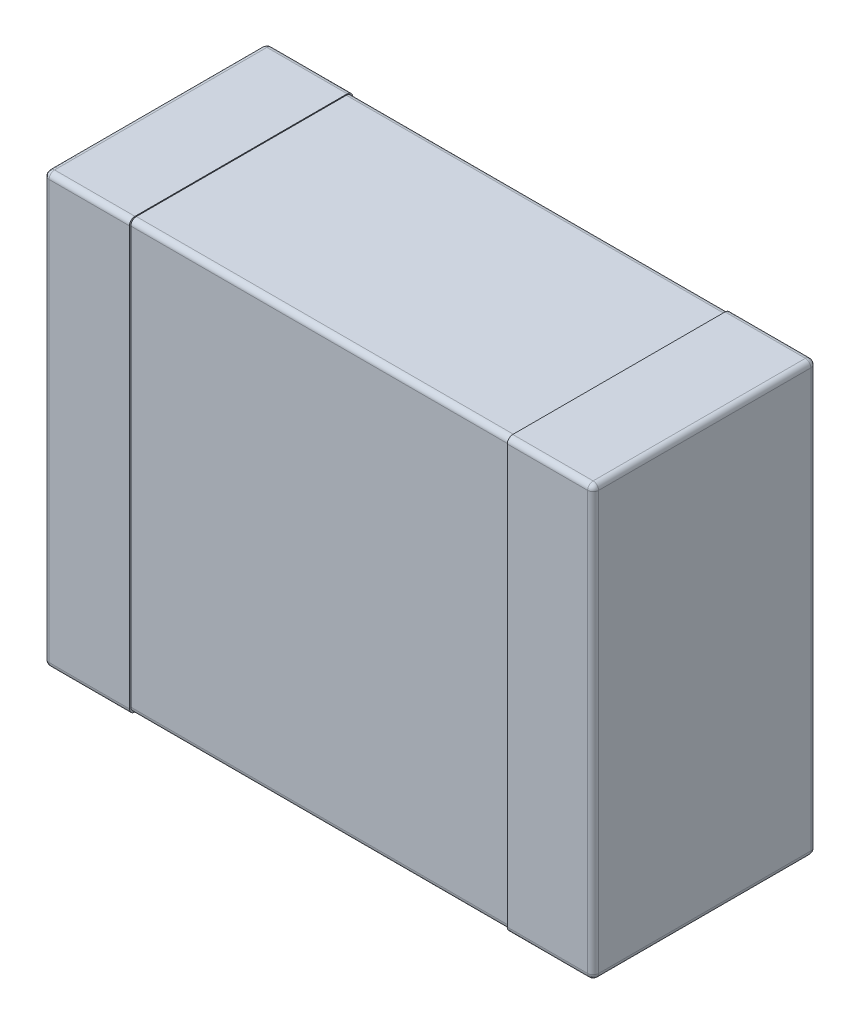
ISO-10303-21;
HEADER;
FILE_DESCRIPTION(('STEP AP214'),'2;1');
FILE_NAME('part.step','',(''),(''),'','','');
FILE_SCHEMA(('AUTOMOTIVE_DESIGN { 1 0 10303 214 1 1 1 1 }'));
ENDSEC;
DATA;
#1=APPLICATION_CONTEXT('core data for automotive mechanical design processes');
#2=APPLICATION_PROTOCOL_DEFINITION('international standard','automotive_design',2000,#1);
#3=PRODUCT_CONTEXT('',#1,'mechanical');
#4=PRODUCT('Part','Part','',(#3));
#5=PRODUCT_RELATED_PRODUCT_CATEGORY('part','',(#4));
#6=PRODUCT_DEFINITION_FORMATION('','',#4);
#7=PRODUCT_DEFINITION_CONTEXT('part definition',#1,'design');
#8=PRODUCT_DEFINITION('design','',#6,#7);
#9=PRODUCT_DEFINITION_SHAPE('','',#8);
#10=(LENGTH_UNIT() NAMED_UNIT(*) SI_UNIT(.MILLI.,.METRE.));
#11=(NAMED_UNIT(*) PLANE_ANGLE_UNIT() SI_UNIT($,.RADIAN.));
#12=(NAMED_UNIT(*) SI_UNIT($,.STERADIAN.) SOLID_ANGLE_UNIT());
#13=UNCERTAINTY_MEASURE_WITH_UNIT(LENGTH_MEASURE(1.E-05),#10,'distance_accuracy_value','');
#14=(GEOMETRIC_REPRESENTATION_CONTEXT(3) GLOBAL_UNCERTAINTY_ASSIGNED_CONTEXT((#13)) GLOBAL_UNIT_ASSIGNED_CONTEXT((#10,
#11,#12)) REPRESENTATION_CONTEXT('',''));
#15=CARTESIAN_POINT('',(0.,0.,0.));
#16=DIRECTION('',(0.,0.,1.));
#17=DIRECTION('',(1.,0.,0.));
#18=AXIS2_PLACEMENT_3D('',#15,#16,#17);
#19=CARTESIAN_POINT('',(-0.0199362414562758,-1.23990729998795,0.00499999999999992));
#20=DIRECTION('',(0.,0.,-1.));
#21=DIRECTION('',(-0.999999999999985,-1.74845553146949E-07,0.));
#22=AXIS2_PLACEMENT_3D('',#19,#20,#21);
#23=PLANE('',#22);
#24=DIRECTION('',(-0.999999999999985,-1.74845553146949E-07,0.));
#25=VECTOR('',#24,1.);
#26=CARTESIAN_POINT('',(-0.0199362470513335,-1.20790729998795,0.00499999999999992));
#27=LINE('',#26,#25);
#28=CARTESIAN_POINT('',(1.08006375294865,-1.20790710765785,0.0049999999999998));
#29=VERTEX_POINT('',#28);
#30=CARTESIAN_POINT('',(-1.11993624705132,-1.20790749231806,0.00500000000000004));
#31=VERTEX_POINT('',#30);
#32=EDGE_CURVE('E11',#29,#31,#27,.T.);
#33=ORIENTED_EDGE('',*,*,#32,.T.);
#34=DIRECTION('',(-1.74845553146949E-07,0.999999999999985,0.));
#35=VECTOR('',#34,1.);
#36=CARTESIAN_POINT('',(-1.11993624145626,-1.23990749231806,0.00500000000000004));
#37=LINE('',#36,#35);
#38=CARTESIAN_POINT('',(-1.11993667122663,1.2180925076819,0.00500000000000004));
#39=VERTEX_POINT('',#38);
#40=EDGE_CURVE('E24',#31,#39,#37,.T.);
#41=ORIENTED_EDGE('',*,*,#40,.T.);
#42=DIRECTION('',(0.999999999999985,1.74845553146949E-07,0.));
#43=VECTOR('',#42,1.);
#44=CARTESIAN_POINT('',(-0.0199366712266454,1.21809270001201,0.00499999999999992));
#45=LINE('',#44,#43);
#46=CARTESIAN_POINT('',(1.08006332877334,1.21809289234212,0.0049999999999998));
#47=VERTEX_POINT('',#46);
#48=EDGE_CURVE('E461',#39,#47,#45,.T.);
#49=ORIENTED_EDGE('',*,*,#48,.T.);
#50=DIRECTION('',(1.74845553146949E-07,-0.999999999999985,0.));
#51=VECTOR('',#50,1.);
#52=CARTESIAN_POINT('',(1.08006375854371,-1.23990710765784,0.0049999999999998));
#53=LINE('',#52,#51);
#54=EDGE_CURVE('E459',#47,#29,#53,.T.);
#55=ORIENTED_EDGE('',*,*,#54,.T.);
#56=EDGE_LOOP('',(#33,#41,#49,#55));
#57=FACE_BOUND('',#56,.T.);
#58=ADVANCED_FACE('F17',(#57),#23,.T.);
#59=CARTESIAN_POINT('',(-1.11993624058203,-1.24490749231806,0.65));
#60=DIRECTION('',(0.999999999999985,1.74845553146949E-07,0.));
#61=DIRECTION('',(0.,0.,-1.));
#62=AXIS2_PLACEMENT_3D('',#59,#60,#61);
#63=PLANE('',#62);
#64=CARTESIAN_POINT('',(-1.11993624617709,-1.21290749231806,0.0320000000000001));
#65=DIRECTION('',(0.999999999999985,1.74845553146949E-07,0.));
#66=DIRECTION('',(0.,0.,1.));
#67=AXIS2_PLACEMENT_3D('',#64,#65,#66);
#68=CIRCLE('',#67,0.032);
#69=CARTESIAN_POINT('',(-1.11993624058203,-1.24490749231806,0.0320000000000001));
#70=VERTEX_POINT('',#69);
#71=CARTESIAN_POINT('',(-1.11993624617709,-1.21290749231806,0.));
#72=VERTEX_POINT('',#71);
#73=EDGE_CURVE('E457',#70,#72,#68,.T.);
#74=ORIENTED_EDGE('',*,*,#73,.T.);
#75=DIRECTION('',(-1.74845553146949E-07,0.999999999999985,0.));
#76=VECTOR('',#75,1.);
#77=CARTESIAN_POINT('',(-1.11993624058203,-1.24490749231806,0.));
#78=LINE('',#77,#76);
#79=CARTESIAN_POINT('',(-1.11993667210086,1.2230925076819,0.));
#80=VERTEX_POINT('',#79);
#81=EDGE_CURVE('E454',#72,#80,#78,.T.);
#82=ORIENTED_EDGE('',*,*,#81,.T.);
#83=CARTESIAN_POINT('',(-1.11993667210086,1.2230925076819,0.0320000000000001));
#84=DIRECTION('',(0.999999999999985,1.74845553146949E-07,0.));
#85=DIRECTION('',(0.,0.,-1.));
#86=AXIS2_PLACEMENT_3D('',#83,#84,#85);
#87=CIRCLE('',#86,0.032);
#88=CARTESIAN_POINT('',(-1.11993667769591,1.2550925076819,0.0320000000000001));
#89=VERTEX_POINT('',#88);
#90=EDGE_CURVE('E452',#80,#89,#87,.T.);
#91=ORIENTED_EDGE('',*,*,#90,.T.);
#92=DIRECTION('',(0.,0.,1.));
#93=VECTOR('',#92,1.);
#94=CARTESIAN_POINT('',(-1.11993667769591,1.2550925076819,0.65));
#95=LINE('',#94,#93);
#96=CARTESIAN_POINT('',(-1.11993667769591,1.2550925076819,1.268));
#97=VERTEX_POINT('',#96);
#98=EDGE_CURVE('E450',#89,#97,#95,.T.);
#99=ORIENTED_EDGE('',*,*,#98,.T.);
#100=CARTESIAN_POINT('',(-1.11993667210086,1.2230925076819,1.268));
#101=DIRECTION('',(0.999999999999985,1.74845553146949E-07,0.));
#102=DIRECTION('',(0.,0.,1.));
#103=AXIS2_PLACEMENT_3D('',#100,#101,#102);
#104=CIRCLE('',#103,0.0319999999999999);
#105=CARTESIAN_POINT('',(-1.11993667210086,1.2230925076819,1.3));
#106=VERTEX_POINT('',#105);
#107=EDGE_CURVE('E448',#97,#106,#104,.T.);
#108=ORIENTED_EDGE('',*,*,#107,.T.);
#109=DIRECTION('',(1.74845553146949E-07,-0.999999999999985,0.));
#110=VECTOR('',#109,1.);
#111=CARTESIAN_POINT('',(-1.11993624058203,-1.24490749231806,1.3));
#112=LINE('',#111,#110);
#113=CARTESIAN_POINT('',(-1.11993624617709,-1.21290749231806,1.3));
#114=VERTEX_POINT('',#113);
#115=EDGE_CURVE('E446',#106,#114,#112,.T.);
#116=ORIENTED_EDGE('',*,*,#115,.T.);
#117=CARTESIAN_POINT('',(-1.11993624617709,-1.21290749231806,1.268));
#118=DIRECTION('',(0.999999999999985,1.74845553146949E-07,0.));
#119=DIRECTION('',(0.,0.,-1.));
#120=AXIS2_PLACEMENT_3D('',#117,#118,#119);
#121=CIRCLE('',#120,0.0319999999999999);
#122=CARTESIAN_POINT('',(-1.11993624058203,-1.24490749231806,1.268));
#123=VERTEX_POINT('',#122);
#124=EDGE_CURVE('E443',#114,#123,#121,.T.);
#125=ORIENTED_EDGE('',*,*,#124,.T.);
#126=DIRECTION('',(0.,0.,-1.));
#127=VECTOR('',#126,1.);
#128=CARTESIAN_POINT('',(-1.11993624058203,-1.24490749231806,0.65));
#129=LINE('',#128,#127);
#130=EDGE_CURVE('E440',#123,#70,#129,.T.);
#131=ORIENTED_EDGE('',*,*,#130,.T.);
#132=EDGE_LOOP('',(#74,#82,#91,#99,#108,#116,#125,#131));
#133=FACE_BOUND('',#132,.T.);
#134=DIRECTION('',(0.,0.,1.));
#135=VECTOR('',#134,1.);
#136=CARTESIAN_POINT('',(-1.11993624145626,-1.23990749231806,0.6485));
#137=LINE('',#136,#135);
#138=CARTESIAN_POINT('',(-1.11993624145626,-1.23990749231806,0.037));
#139=VERTEX_POINT('',#138);
#140=CARTESIAN_POINT('',(-1.11993624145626,-1.23990749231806,1.26));
#141=VERTEX_POINT('',#140);
#142=EDGE_CURVE('E437',#139,#141,#137,.T.);
#143=ORIENTED_EDGE('',*,*,#142,.T.);
#144=CARTESIAN_POINT('',(-1.11993624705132,-1.20790749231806,1.26));
#145=DIRECTION('',(0.999999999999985,1.74845553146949E-07,0.));
#146=DIRECTION('',(0.,0.,1.));
#147=AXIS2_PLACEMENT_3D('',#144,#145,#146);
#148=CIRCLE('',#147,0.0319999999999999);
#149=CARTESIAN_POINT('',(-1.11993624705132,-1.20790749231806,1.292));
#150=VERTEX_POINT('',#149);
#151=EDGE_CURVE('E435',#150,#141,#148,.T.);
#152=ORIENTED_EDGE('',*,*,#151,.F.);
#153=DIRECTION('',(-1.74845553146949E-07,0.999999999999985,0.));
#154=VECTOR('',#153,1.);
#155=CARTESIAN_POINT('',(-1.11993624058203,-1.24490749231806,1.292));
#156=LINE('',#155,#154);
#157=CARTESIAN_POINT('',(-1.11993667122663,1.2180925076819,1.292));
#158=VERTEX_POINT('',#157);
#159=EDGE_CURVE('E432',#150,#158,#156,.T.);
#160=ORIENTED_EDGE('',*,*,#159,.T.);
#161=CARTESIAN_POINT('',(-1.11993667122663,1.2180925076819,1.26));
#162=DIRECTION('',(0.999999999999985,1.74845553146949E-07,0.));
#163=DIRECTION('',(0.,0.,1.));
#164=AXIS2_PLACEMENT_3D('',#161,#162,#163);
#165=CIRCLE('',#164,0.0319999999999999);
#166=CARTESIAN_POINT('',(-1.11993667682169,1.2500925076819,1.26));
#167=VERTEX_POINT('',#166);
#168=EDGE_CURVE('E429',#167,#158,#165,.T.);
#169=ORIENTED_EDGE('',*,*,#168,.F.);
#170=DIRECTION('',(0.,0.,1.));
#171=VECTOR('',#170,1.);
#172=CARTESIAN_POINT('',(-1.11993667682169,1.2500925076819,0.6485));
#173=LINE('',#172,#171);
#174=CARTESIAN_POINT('',(-1.11993667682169,1.2500925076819,0.0370000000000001));
#175=VERTEX_POINT('',#174);
#176=EDGE_CURVE('E427',#175,#167,#173,.T.);
#177=ORIENTED_EDGE('',*,*,#176,.F.);
#178=CARTESIAN_POINT('',(-1.11993667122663,1.2180925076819,0.037));
#179=DIRECTION('',(-0.999999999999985,-1.74845553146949E-07,0.));
#180=DIRECTION('',(0.,0.,-1.));
#181=AXIS2_PLACEMENT_3D('',#178,#179,#180);
#182=CIRCLE('',#181,0.032);
#183=EDGE_CURVE('E424',#175,#39,#182,.T.);
#184=ORIENTED_EDGE('',*,*,#183,.T.);
#185=ORIENTED_EDGE('',*,*,#40,.F.);
#186=CARTESIAN_POINT('',(-1.11993624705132,-1.20790749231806,0.037));
#187=DIRECTION('',(-0.999999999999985,-1.74845553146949E-07,0.));
#188=DIRECTION('',(0.,0.,-1.));
#189=AXIS2_PLACEMENT_3D('',#186,#187,#188);
#190=CIRCLE('',#189,0.032);
#191=EDGE_CURVE('E421',#31,#139,#190,.T.);
#192=ORIENTED_EDGE('',*,*,#191,.T.);
#193=EDGE_LOOP('',(#143,#152,#160,#169,#177,#184,#185,#192));
#194=FACE_BOUND('',#193,.T.);
#195=ADVANCED_FACE('F466',(#133,#194),#63,.T.);
#196=CARTESIAN_POINT('',(-0.0199362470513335,-1.20790729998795,0.0369999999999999));
#197=DIRECTION('',(0.999999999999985,1.74845553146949E-07,0.));
#198=DIRECTION('',(0.,0.,-1.));
#199=AXIS2_PLACEMENT_3D('',#196,#197,#198);
#200=CYLINDRICAL_SURFACE('',#199,0.032);
#201=CARTESIAN_POINT('',(1.08006375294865,-1.20790710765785,0.0369999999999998));
#202=DIRECTION('',(-0.999999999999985,-1.74845553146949E-07,0.));
#203=DIRECTION('',(0.,0.,-1.));
#204=AXIS2_PLACEMENT_3D('',#201,#202,#203);
#205=CIRCLE('',#204,0.032);
#206=CARTESIAN_POINT('',(1.08006375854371,-1.23990710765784,0.0369999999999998));
#207=VERTEX_POINT('',#206);
#208=EDGE_CURVE('E419',#29,#207,#205,.T.);
#209=ORIENTED_EDGE('',*,*,#208,.T.);
#210=DIRECTION('',(-0.999999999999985,-1.74845553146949E-07,0.));
#211=VECTOR('',#210,1.);
#212=CARTESIAN_POINT('',(-0.0199362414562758,-1.23990729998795,0.0369999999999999));
#213=LINE('',#212,#211);
#214=EDGE_CURVE('E417',#207,#139,#213,.T.);
#215=ORIENTED_EDGE('',*,*,#214,.T.);
#216=ORIENTED_EDGE('',*,*,#191,.F.);
#217=ORIENTED_EDGE('',*,*,#32,.F.);
#218=EDGE_LOOP('',(#209,#215,#216,#217));
#219=FACE_BOUND('',#218,.T.);
#220=ADVANCED_FACE('F478',(#219),#200,.T.);
#221=CARTESIAN_POINT('',(1.08006375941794,-1.24490710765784,0.65));
#222=DIRECTION('',(-0.999999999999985,-1.74845553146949E-07,0.));
#223=DIRECTION('',(0.,0.,1.));
#224=AXIS2_PLACEMENT_3D('',#221,#222,#223);
#225=PLANE('',#224);
#226=CARTESIAN_POINT('',(1.08006375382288,-1.21290710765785,0.0319999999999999));
#227=DIRECTION('',(-0.999999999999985,-1.74845553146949E-07,0.));
#228=DIRECTION('',(0.,0.,-1.));
#229=AXIS2_PLACEMENT_3D('',#226,#227,#228);
#230=CIRCLE('',#229,0.032);
#231=CARTESIAN_POINT('',(1.08006375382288,-1.21290710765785,0.));
#232=VERTEX_POINT('',#231);
#233=CARTESIAN_POINT('',(1.08006375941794,-1.24490710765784,0.0319999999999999));
#234=VERTEX_POINT('',#233);
#235=EDGE_CURVE('E415',#232,#234,#230,.T.);
#236=ORIENTED_EDGE('',*,*,#235,.T.);
#237=DIRECTION('',(0.,0.,1.));
#238=VECTOR('',#237,1.);
#239=CARTESIAN_POINT('',(1.08006375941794,-1.24490710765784,0.65));
#240=LINE('',#239,#238);
#241=CARTESIAN_POINT('',(1.08006375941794,-1.24490710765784,1.268));
#242=VERTEX_POINT('',#241);
#243=EDGE_CURVE('E413',#234,#242,#240,.T.);
#244=ORIENTED_EDGE('',*,*,#243,.T.);
#245=CARTESIAN_POINT('',(1.08006375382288,-1.21290710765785,1.268));
#246=DIRECTION('',(-0.999999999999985,-1.74845553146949E-07,0.));
#247=DIRECTION('',(0.,0.,1.));
#248=AXIS2_PLACEMENT_3D('',#245,#246,#247);
#249=CIRCLE('',#248,0.0319999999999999);
#250=CARTESIAN_POINT('',(1.08006375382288,-1.21290710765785,1.3));
#251=VERTEX_POINT('',#250);
#252=EDGE_CURVE('E410',#242,#251,#249,.T.);
#253=ORIENTED_EDGE('',*,*,#252,.T.);
#254=DIRECTION('',(-1.74845553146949E-07,0.999999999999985,0.));
#255=VECTOR('',#254,1.);
#256=CARTESIAN_POINT('',(1.08006375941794,-1.24490710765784,1.3));
#257=LINE('',#256,#255);
#258=CARTESIAN_POINT('',(1.08006332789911,1.22309289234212,1.3));
#259=VERTEX_POINT('',#258);
#260=EDGE_CURVE('E407',#251,#259,#257,.T.);
#261=ORIENTED_EDGE('',*,*,#260,.T.);
#262=CARTESIAN_POINT('',(1.08006332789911,1.22309289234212,1.268));
#263=DIRECTION('',(-0.999999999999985,-1.74845553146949E-07,0.));
#264=DIRECTION('',(0.,0.,1.));
#265=AXIS2_PLACEMENT_3D('',#262,#263,#264);
#266=CIRCLE('',#265,0.0319999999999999);
#267=CARTESIAN_POINT('',(1.08006332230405,1.25509289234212,1.268));
#268=VERTEX_POINT('',#267);
#269=EDGE_CURVE('E404',#259,#268,#266,.T.);
#270=ORIENTED_EDGE('',*,*,#269,.T.);
#271=DIRECTION('',(0.,0.,-1.));
#272=VECTOR('',#271,1.);
#273=CARTESIAN_POINT('',(1.08006332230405,1.25509289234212,0.65));
#274=LINE('',#273,#272);
#275=CARTESIAN_POINT('',(1.08006332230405,1.25509289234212,0.0319999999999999));
#276=VERTEX_POINT('',#275);
#277=EDGE_CURVE('E402',#268,#276,#274,.T.);
#278=ORIENTED_EDGE('',*,*,#277,.T.);
#279=CARTESIAN_POINT('',(1.08006332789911,1.22309289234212,0.0319999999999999));
#280=DIRECTION('',(-0.999999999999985,-1.74845553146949E-07,0.));
#281=DIRECTION('',(0.,0.,-1.));
#282=AXIS2_PLACEMENT_3D('',#279,#280,#281);
#283=CIRCLE('',#282,0.032);
#284=CARTESIAN_POINT('',(1.08006332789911,1.22309289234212,0.));
#285=VERTEX_POINT('',#284);
#286=EDGE_CURVE('E400',#276,#285,#283,.T.);
#287=ORIENTED_EDGE('',*,*,#286,.T.);
#288=DIRECTION('',(1.74845553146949E-07,-0.999999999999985,0.));
#289=VECTOR('',#288,1.);
#290=CARTESIAN_POINT('',(1.08006375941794,-1.24490710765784,0.));
#291=LINE('',#290,#289);
#292=EDGE_CURVE('E398',#285,#232,#291,.T.);
#293=ORIENTED_EDGE('',*,*,#292,.T.);
#294=EDGE_LOOP('',(#236,#244,#253,#261,#270,#278,#287,#293));
#295=FACE_BOUND('',#294,.T.);
#296=CARTESIAN_POINT('',(1.08006332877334,1.21809289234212,0.0369999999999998));
#297=DIRECTION('',(0.999999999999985,1.74845553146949E-07,0.));
#298=DIRECTION('',(0.,0.,-1.));
#299=AXIS2_PLACEMENT_3D('',#296,#297,#298);
#300=CIRCLE('',#299,0.032);
#301=CARTESIAN_POINT('',(1.08006332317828,1.25009289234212,0.0369999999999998));
#302=VERTEX_POINT('',#301);
#303=EDGE_CURVE('E396',#47,#302,#300,.T.);
#304=ORIENTED_EDGE('',*,*,#303,.T.);
#305=DIRECTION('',(0.,0.,-1.));
#306=VECTOR('',#305,1.);
#307=CARTESIAN_POINT('',(1.08006332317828,1.25009289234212,0.6485));
#308=LINE('',#307,#306);
#309=CARTESIAN_POINT('',(1.08006332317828,1.25009289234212,1.26));
#310=VERTEX_POINT('',#309);
#311=EDGE_CURVE('E393',#310,#302,#308,.T.);
#312=ORIENTED_EDGE('',*,*,#311,.F.);
#313=CARTESIAN_POINT('',(1.08006332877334,1.21809289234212,1.26));
#314=DIRECTION('',(-0.999999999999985,-1.74845553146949E-07,0.));
#315=DIRECTION('',(0.,0.,1.));
#316=AXIS2_PLACEMENT_3D('',#313,#314,#315);
#317=CIRCLE('',#316,0.0319999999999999);
#318=CARTESIAN_POINT('',(1.08006332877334,1.21809289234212,1.292));
#319=VERTEX_POINT('',#318);
#320=EDGE_CURVE('E390',#319,#310,#317,.T.);
#321=ORIENTED_EDGE('',*,*,#320,.F.);
#322=DIRECTION('',(1.74845553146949E-07,-0.999999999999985,0.));
#323=VECTOR('',#322,1.);
#324=CARTESIAN_POINT('',(1.08006375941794,-1.24490710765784,1.292));
#325=LINE('',#324,#323);
#326=CARTESIAN_POINT('',(1.08006375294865,-1.20790710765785,1.292));
#327=VERTEX_POINT('',#326);
#328=EDGE_CURVE('E388',#319,#327,#325,.T.);
#329=ORIENTED_EDGE('',*,*,#328,.T.);
#330=CARTESIAN_POINT('',(1.08006375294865,-1.20790710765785,1.26));
#331=DIRECTION('',(-0.999999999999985,-1.74845553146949E-07,0.));
#332=DIRECTION('',(0.,0.,1.));
#333=AXIS2_PLACEMENT_3D('',#330,#331,#332);
#334=CIRCLE('',#333,0.0319999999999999);
#335=CARTESIAN_POINT('',(1.08006375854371,-1.23990710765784,1.26));
#336=VERTEX_POINT('',#335);
#337=EDGE_CURVE('E385',#336,#327,#334,.T.);
#338=ORIENTED_EDGE('',*,*,#337,.F.);
#339=DIRECTION('',(0.,0.,-1.));
#340=VECTOR('',#339,1.);
#341=CARTESIAN_POINT('',(1.08006375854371,-1.23990710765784,0.65));
#342=LINE('',#341,#340);
#343=EDGE_CURVE('E382',#336,#207,#342,.T.);
#344=ORIENTED_EDGE('',*,*,#343,.T.);
#345=ORIENTED_EDGE('',*,*,#208,.F.);
#346=ORIENTED_EDGE('',*,*,#54,.F.);
#347=EDGE_LOOP('',(#304,#312,#321,#329,#338,#344,#345,#346));
#348=FACE_BOUND('',#347,.T.);
#349=ADVANCED_FACE('F474',(#295,#348),#225,.T.);
#350=CARTESIAN_POINT('',(-0.0199366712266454,1.21809270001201,0.0369999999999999));
#351=DIRECTION('',(0.999999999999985,1.74845553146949E-07,0.));
#352=DIRECTION('',(0.,0.,-1.));
#353=AXIS2_PLACEMENT_3D('',#350,#351,#352);
#354=CYLINDRICAL_SURFACE('',#353,0.032);
#355=ORIENTED_EDGE('',*,*,#303,.F.);
#356=ORIENTED_EDGE('',*,*,#48,.F.);
#357=ORIENTED_EDGE('',*,*,#183,.F.);
#358=DIRECTION('',(0.999999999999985,1.74845553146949E-07,0.));
#359=VECTOR('',#358,1.);
#360=CARTESIAN_POINT('',(-0.0199366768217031,1.25009270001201,0.037));
#361=LINE('',#360,#359);
#362=EDGE_CURVE('E379',#175,#302,#361,.T.);
#363=ORIENTED_EDGE('',*,*,#362,.T.);
#364=EDGE_LOOP('',(#355,#356,#357,#363));
#365=FACE_BOUND('',#364,.T.);
#366=ADVANCED_FACE('F471',(#365),#354,.T.);
#367=CARTESIAN_POINT('',(-1.36993624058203,-1.24490753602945,0.));
#368=DIRECTION('',(0.,0.,-1.));
#369=DIRECTION('',(-0.999999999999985,-1.74845553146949E-07,0.));
#370=AXIS2_PLACEMENT_3D('',#367,#368,#369);
#371=PLANE('',#370);
#372=DIRECTION('',(-0.999999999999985,-1.74845553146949E-07,0.));
#373=VECTOR('',#372,1.);
#374=CARTESIAN_POINT('',(-1.36993624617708,-1.21290753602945,0.));
#375=LINE('',#374,#373);
#376=CARTESIAN_POINT('',(-1.58793624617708,-1.21290757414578,0.));
#377=VERTEX_POINT('',#376);
#378=EDGE_CURVE('E376',#72,#377,#375,.T.);
#379=ORIENTED_EDGE('',*,*,#378,.T.);
#380=DIRECTION('',(-1.74845553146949E-07,0.999999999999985,0.));
#381=VECTOR('',#380,1.);
#382=CARTESIAN_POINT('',(-1.58793624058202,-1.24490757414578,0.));
#383=LINE('',#382,#381);
#384=CARTESIAN_POINT('',(-1.58793667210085,1.22309242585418,0.));
#385=VERTEX_POINT('',#384);
#386=EDGE_CURVE('E373',#377,#385,#383,.T.);
#387=ORIENTED_EDGE('',*,*,#386,.T.);
#388=DIRECTION('',(0.999999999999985,1.74845553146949E-07,0.));
#389=VECTOR('',#388,1.);
#390=CARTESIAN_POINT('',(-1.36993667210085,1.22309246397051,0.));
#391=LINE('',#390,#389);
#392=EDGE_CURVE('E370',#385,#80,#391,.T.);
#393=ORIENTED_EDGE('',*,*,#392,.T.);
#394=ORIENTED_EDGE('',*,*,#81,.F.);
#395=EDGE_LOOP('',(#379,#387,#393,#394));
#396=FACE_BOUND('',#395,.T.);
#397=ADVANCED_FACE('F529',(#396),#371,.T.);
#398=CARTESIAN_POINT('',(-1.36993624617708,-1.21290753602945,0.0320000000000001));
#399=DIRECTION('',(-0.999999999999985,-1.74845553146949E-07,0.));
#400=DIRECTION('',(0.,0.,1.));
#401=AXIS2_PLACEMENT_3D('',#398,#399,#400);
#402=CYLINDRICAL_SURFACE('',#401,0.032);
#403=CARTESIAN_POINT('',(-1.58793624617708,-1.21290757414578,0.0320000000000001));
#404=DIRECTION('',(0.999999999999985,1.74845553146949E-07,0.));
#405=DIRECTION('',(0.,0.,1.));
#406=AXIS2_PLACEMENT_3D('',#403,#404,#405);
#407=CIRCLE('',#406,0.032);
#408=CARTESIAN_POINT('',(-1.58793624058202,-1.24490757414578,0.0320000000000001));
#409=VERTEX_POINT('',#408);
#410=EDGE_CURVE('E368',#409,#377,#407,.T.);
#411=ORIENTED_EDGE('',*,*,#410,.T.);
#412=ORIENTED_EDGE('',*,*,#378,.F.);
#413=ORIENTED_EDGE('',*,*,#73,.F.);
#414=DIRECTION('',(-0.999999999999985,-1.74845553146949E-07,0.));
#415=VECTOR('',#414,1.);
#416=CARTESIAN_POINT('',(-1.36993624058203,-1.24490753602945,0.0320000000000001));
#417=LINE('',#416,#415);
#418=EDGE_CURVE('E365',#70,#409,#417,.T.);
#419=ORIENTED_EDGE('',*,*,#418,.T.);
#420=EDGE_LOOP('',(#411,#412,#413,#419));
#421=FACE_BOUND('',#420,.T.);
#422=ADVANCED_FACE('F532',(#421),#402,.T.);
#423=CARTESIAN_POINT('',(-1.36993624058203,-1.24490753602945,0.65));
#424=DIRECTION('',(-1.74845553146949E-07,0.999999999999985,0.));
#425=DIRECTION('',(0.,0.,1.));
#426=AXIS2_PLACEMENT_3D('',#423,#424,#425);
#427=PLANE('',#426);
#428=ORIENTED_EDGE('',*,*,#130,.F.);
#429=DIRECTION('',(0.999999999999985,1.74845553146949E-07,0.));
#430=VECTOR('',#429,1.);
#431=CARTESIAN_POINT('',(-1.36993624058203,-1.24490753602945,1.268));
#432=LINE('',#431,#430);
#433=CARTESIAN_POINT('',(-1.58793624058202,-1.24490757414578,1.268));
#434=VERTEX_POINT('',#433);
#435=EDGE_CURVE('E363',#434,#123,#432,.T.);
#436=ORIENTED_EDGE('',*,*,#435,.F.);
#437=DIRECTION('',(0.,0.,1.));
#438=VECTOR('',#437,1.);
#439=CARTESIAN_POINT('',(-1.58793624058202,-1.24490757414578,0.65));
#440=LINE('',#439,#438);
#441=EDGE_CURVE('E360',#409,#434,#440,.T.);
#442=ORIENTED_EDGE('',*,*,#441,.F.);
#443=ORIENTED_EDGE('',*,*,#418,.F.);
#444=EDGE_LOOP('',(#428,#436,#442,#443));
#445=FACE_BOUND('',#444,.T.);
#446=ADVANCED_FACE('F536',(#445),#427,.F.);
#447=CARTESIAN_POINT('',(-1.36993624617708,-1.21290753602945,1.268));
#448=DIRECTION('',(0.999999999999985,1.74845553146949E-07,0.));
#449=DIRECTION('',(0.,0.,-1.));
#450=AXIS2_PLACEMENT_3D('',#447,#448,#449);
#451=CYLINDRICAL_SURFACE('',#450,0.0319999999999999);
#452=CARTESIAN_POINT('',(-1.58793624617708,-1.21290757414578,1.268));
#453=DIRECTION('',(0.999999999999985,1.74845553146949E-07,0.));
#454=DIRECTION('',(0.,0.,-1.));
#455=AXIS2_PLACEMENT_3D('',#452,#453,#454);
#456=CIRCLE('',#455,0.0319999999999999);
#457=CARTESIAN_POINT('',(-1.58793624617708,-1.21290757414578,1.3));
#458=VERTEX_POINT('',#457);
#459=EDGE_CURVE('E357',#458,#434,#456,.T.);
#460=ORIENTED_EDGE('',*,*,#459,.T.);
#461=ORIENTED_EDGE('',*,*,#435,.T.);
#462=ORIENTED_EDGE('',*,*,#124,.F.);
#463=DIRECTION('',(-0.999999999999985,-1.74845553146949E-07,0.));
#464=VECTOR('',#463,1.);
#465=CARTESIAN_POINT('',(-1.36993624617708,-1.21290753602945,1.3));
#466=LINE('',#465,#464);
#467=EDGE_CURVE('E354',#114,#458,#466,.T.);
#468=ORIENTED_EDGE('',*,*,#467,.T.);
#469=EDGE_LOOP('',(#460,#461,#462,#468));
#470=FACE_BOUND('',#469,.T.);
#471=ADVANCED_FACE('F540',(#470),#451,.T.);
#472=CARTESIAN_POINT('',(-1.36993624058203,-1.24490753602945,1.3));
#473=DIRECTION('',(0.,0.,1.));
#474=DIRECTION('',(0.999999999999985,1.74845553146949E-07,0.));
#475=AXIS2_PLACEMENT_3D('',#472,#473,#474);
#476=PLANE('',#475);
#477=ORIENTED_EDGE('',*,*,#467,.F.);
#478=ORIENTED_EDGE('',*,*,#115,.F.);
#479=DIRECTION('',(-0.999999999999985,-1.74845553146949E-07,0.));
#480=VECTOR('',#479,1.);
#481=CARTESIAN_POINT('',(-1.36993667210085,1.22309246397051,1.3));
#482=LINE('',#481,#480);
#483=CARTESIAN_POINT('',(-1.58793667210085,1.22309242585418,1.3));
#484=VERTEX_POINT('',#483);
#485=EDGE_CURVE('E351',#106,#484,#482,.T.);
#486=ORIENTED_EDGE('',*,*,#485,.T.);
#487=DIRECTION('',(1.74845553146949E-07,-0.999999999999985,0.));
#488=VECTOR('',#487,1.);
#489=CARTESIAN_POINT('',(-1.58793624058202,-1.24490757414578,1.3));
#490=LINE('',#489,#488);
#491=EDGE_CURVE('E348',#484,#458,#490,.T.);
#492=ORIENTED_EDGE('',*,*,#491,.T.);
#493=EDGE_LOOP('',(#477,#478,#486,#492));
#494=FACE_BOUND('',#493,.T.);
#495=ADVANCED_FACE('F544',(#494),#476,.T.);
#496=CARTESIAN_POINT('',(-1.36993667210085,1.22309246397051,1.268));
#497=DIRECTION('',(-0.999999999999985,-1.74845553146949E-07,0.));
#498=DIRECTION('',(0.,0.,1.));
#499=AXIS2_PLACEMENT_3D('',#496,#497,#498);
#500=CYLINDRICAL_SURFACE('',#499,0.0319999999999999);
#501=CARTESIAN_POINT('',(-1.58793667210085,1.22309242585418,1.268));
#502=DIRECTION('',(0.999999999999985,1.74845553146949E-07,0.));
#503=DIRECTION('',(0.,0.,1.));
#504=AXIS2_PLACEMENT_3D('',#501,#502,#503);
#505=CIRCLE('',#504,0.0319999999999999);
#506=CARTESIAN_POINT('',(-1.58793667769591,1.25509242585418,1.268));
#507=VERTEX_POINT('',#506);
#508=EDGE_CURVE('E345',#507,#484,#505,.T.);
#509=ORIENTED_EDGE('',*,*,#508,.T.);
#510=ORIENTED_EDGE('',*,*,#485,.F.);
#511=ORIENTED_EDGE('',*,*,#107,.F.);
#512=DIRECTION('',(-0.999999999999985,-1.74845553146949E-07,0.));
#513=VECTOR('',#512,1.);
#514=CARTESIAN_POINT('',(-1.36993667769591,1.25509246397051,1.268));
#515=LINE('',#514,#513);
#516=EDGE_CURVE('E342',#97,#507,#515,.T.);
#517=ORIENTED_EDGE('',*,*,#516,.T.);
#518=EDGE_LOOP('',(#509,#510,#511,#517));
#519=FACE_BOUND('',#518,.T.);
#520=ADVANCED_FACE('F548',(#519),#500,.T.);
#521=CARTESIAN_POINT('',(-1.36993667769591,1.25509246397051,0.65));
#522=DIRECTION('',(-1.74845553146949E-07,0.999999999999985,0.));
#523=DIRECTION('',(0.,0.,1.));
#524=AXIS2_PLACEMENT_3D('',#521,#522,#523);
#525=PLANE('',#524);
#526=ORIENTED_EDGE('',*,*,#516,.F.);
#527=ORIENTED_EDGE('',*,*,#98,.F.);
#528=DIRECTION('',(-0.999999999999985,-1.74845553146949E-07,0.));
#529=VECTOR('',#528,1.);
#530=CARTESIAN_POINT('',(-1.36993667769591,1.25509246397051,0.0320000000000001));
#531=LINE('',#530,#529);
#532=CARTESIAN_POINT('',(-1.58793667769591,1.25509242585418,0.0320000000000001));
#533=VERTEX_POINT('',#532);
#534=EDGE_CURVE('E339',#89,#533,#531,.T.);
#535=ORIENTED_EDGE('',*,*,#534,.T.);
#536=DIRECTION('',(0.,0.,1.));
#537=VECTOR('',#536,1.);
#538=CARTESIAN_POINT('',(-1.58793667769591,1.25509242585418,0.65));
#539=LINE('',#538,#537);
#540=EDGE_CURVE('E336',#533,#507,#539,.T.);
#541=ORIENTED_EDGE('',*,*,#540,.T.);
#542=EDGE_LOOP('',(#526,#527,#535,#541));
#543=FACE_BOUND('',#542,.T.);
#544=ADVANCED_FACE('F552',(#543),#525,.T.);
#545=CARTESIAN_POINT('',(-1.36993667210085,1.22309246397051,0.0320000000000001));
#546=DIRECTION('',(0.999999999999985,1.74845553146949E-07,0.));
#547=DIRECTION('',(0.,0.,-1.));
#548=AXIS2_PLACEMENT_3D('',#545,#546,#547);
#549=CYLINDRICAL_SURFACE('',#548,0.032);
#550=CARTESIAN_POINT('',(-1.58793667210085,1.22309242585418,0.0320000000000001));
#551=DIRECTION('',(0.999999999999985,1.74845553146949E-07,0.));
#552=DIRECTION('',(0.,0.,-1.));
#553=AXIS2_PLACEMENT_3D('',#550,#551,#552);
#554=CIRCLE('',#553,0.032);
#555=EDGE_CURVE('E333',#385,#533,#554,.T.);
#556=ORIENTED_EDGE('',*,*,#555,.T.);
#557=ORIENTED_EDGE('',*,*,#534,.F.);
#558=ORIENTED_EDGE('',*,*,#90,.F.);
#559=ORIENTED_EDGE('',*,*,#392,.F.);
#560=EDGE_LOOP('',(#556,#557,#558,#559));
#561=FACE_BOUND('',#560,.T.);
#562=ADVANCED_FACE('F556',(#561),#549,.T.);
#563=CARTESIAN_POINT('',(-0.0199362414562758,-1.23990729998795,1.292));
#564=DIRECTION('',(0.,0.,1.));
#565=DIRECTION('',(0.999999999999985,1.74845553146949E-07,0.));
#566=AXIS2_PLACEMENT_3D('',#563,#564,#565);
#567=PLANE('',#566);
#568=DIRECTION('',(-0.999999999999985,-1.74845553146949E-07,0.));
#569=VECTOR('',#568,1.);
#570=CARTESIAN_POINT('',(-0.0199366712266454,1.21809270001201,1.292));
#571=LINE('',#570,#569);
#572=EDGE_CURVE('E331',#319,#158,#571,.T.);
#573=ORIENTED_EDGE('',*,*,#572,.T.);
#574=ORIENTED_EDGE('',*,*,#159,.F.);
#575=DIRECTION('',(0.999999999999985,1.74845553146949E-07,0.));
#576=VECTOR('',#575,1.);
#577=CARTESIAN_POINT('',(-0.0199362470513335,-1.20790729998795,1.292));
#578=LINE('',#577,#576);
#579=EDGE_CURVE('E328',#150,#327,#578,.T.);
#580=ORIENTED_EDGE('',*,*,#579,.T.);
#581=ORIENTED_EDGE('',*,*,#328,.F.);
#582=EDGE_LOOP('',(#573,#574,#580,#581));
#583=FACE_BOUND('',#582,.T.);
#584=ADVANCED_FACE('F489',(#583),#567,.T.);
#585=CARTESIAN_POINT('',(-0.0199362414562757,-1.23990729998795,0.6485));
#586=DIRECTION('',(-1.74845553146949E-07,0.999999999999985,0.));
#587=DIRECTION('',(0.,0.,1.));
#588=AXIS2_PLACEMENT_3D('',#585,#586,#587);
#589=PLANE('',#588);
#590=ORIENTED_EDGE('',*,*,#142,.F.);
#591=ORIENTED_EDGE('',*,*,#214,.F.);
#592=ORIENTED_EDGE('',*,*,#343,.F.);
#593=DIRECTION('',(0.999999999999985,1.74845553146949E-07,0.));
#594=VECTOR('',#593,1.);
#595=CARTESIAN_POINT('',(-0.0199362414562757,-1.23990729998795,1.26));
#596=LINE('',#595,#594);
#597=EDGE_CURVE('E325',#141,#336,#596,.T.);
#598=ORIENTED_EDGE('',*,*,#597,.F.);
#599=EDGE_LOOP('',(#590,#591,#592,#598));
#600=FACE_BOUND('',#599,.T.);
#601=ADVANCED_FACE('F481',(#600),#589,.F.);
#602=CARTESIAN_POINT('',(1.33006375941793,-1.24490706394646,0.65));
#603=DIRECTION('',(-1.74845553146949E-07,0.999999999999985,0.));
#604=DIRECTION('',(0.,0.,1.));
#605=AXIS2_PLACEMENT_3D('',#602,#603,#604);
#606=PLANE('',#605);
#607=ORIENTED_EDGE('',*,*,#243,.F.);
#608=DIRECTION('',(-0.999999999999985,-1.74845553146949E-07,0.));
#609=VECTOR('',#608,1.);
#610=CARTESIAN_POINT('',(1.33006375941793,-1.24490706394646,0.0319999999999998));
#611=LINE('',#610,#609);
#612=CARTESIAN_POINT('',(1.54806375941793,-1.24490702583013,0.0319999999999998));
#613=VERTEX_POINT('',#612);
#614=EDGE_CURVE('E322',#613,#234,#611,.T.);
#615=ORIENTED_EDGE('',*,*,#614,.F.);
#616=DIRECTION('',(0.,0.,-1.));
#617=VECTOR('',#616,1.);
#618=CARTESIAN_POINT('',(1.54806375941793,-1.24490702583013,0.65));
#619=LINE('',#618,#617);
#620=CARTESIAN_POINT('',(1.54806375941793,-1.24490702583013,1.268));
#621=VERTEX_POINT('',#620);
#622=EDGE_CURVE('E319',#621,#613,#619,.T.);
#623=ORIENTED_EDGE('',*,*,#622,.F.);
#624=DIRECTION('',(0.999999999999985,1.74845553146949E-07,0.));
#625=VECTOR('',#624,1.);
#626=CARTESIAN_POINT('',(1.33006375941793,-1.24490706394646,1.268));
#627=LINE('',#626,#625);
#628=EDGE_CURVE('E316',#242,#621,#627,.T.);
#629=ORIENTED_EDGE('',*,*,#628,.F.);
#630=EDGE_LOOP('',(#607,#615,#623,#629));
#631=FACE_BOUND('',#630,.T.);
#632=ADVANCED_FACE('F564',(#631),#606,.F.);
#633=CARTESIAN_POINT('',(1.33006375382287,-1.21290706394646,0.0319999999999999));
#634=DIRECTION('',(0.999999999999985,1.74845553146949E-07,0.));
#635=DIRECTION('',(0.,0.,-1.));
#636=AXIS2_PLACEMENT_3D('',#633,#634,#635);
#637=CYLINDRICAL_SURFACE('',#636,0.032);
#638=CARTESIAN_POINT('',(1.54806375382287,-1.21290702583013,0.0319999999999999));
#639=DIRECTION('',(-0.999999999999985,-1.74845553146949E-07,0.));
#640=DIRECTION('',(0.,0.,-1.));
#641=AXIS2_PLACEMENT_3D('',#638,#639,#640);
#642=CIRCLE('',#641,0.032);
#643=CARTESIAN_POINT('',(1.54806375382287,-1.21290702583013,0.));
#644=VERTEX_POINT('',#643);
#645=EDGE_CURVE('E313',#644,#613,#642,.T.);
#646=ORIENTED_EDGE('',*,*,#645,.T.);
#647=ORIENTED_EDGE('',*,*,#614,.T.);
#648=ORIENTED_EDGE('',*,*,#235,.F.);
#649=DIRECTION('',(0.999999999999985,1.74845553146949E-07,0.));
#650=VECTOR('',#649,1.);
#651=CARTESIAN_POINT('',(1.33006375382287,-1.21290706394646,0.));
#652=LINE('',#651,#650);
#653=EDGE_CURVE('E310',#232,#644,#652,.T.);
#654=ORIENTED_EDGE('',*,*,#653,.T.);
#655=EDGE_LOOP('',(#646,#647,#648,#654));
#656=FACE_BOUND('',#655,.T.);
#657=ADVANCED_FACE('F567',(#656),#637,.T.);
#658=CARTESIAN_POINT('',(1.33006375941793,-1.24490706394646,0.));
#659=DIRECTION('',(0.,0.,-1.));
#660=DIRECTION('',(-0.999999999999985,-1.74845553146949E-07,0.));
#661=AXIS2_PLACEMENT_3D('',#658,#659,#660);
#662=PLANE('',#661);
#663=DIRECTION('',(0.999999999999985,1.74845553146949E-07,0.));
#664=VECTOR('',#663,1.);
#665=CARTESIAN_POINT('',(1.33006332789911,1.22309293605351,0.));
#666=LINE('',#665,#664);
#667=CARTESIAN_POINT('',(1.5480633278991,1.22309297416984,0.));
#668=VERTEX_POINT('',#667);
#669=EDGE_CURVE('E307',#285,#668,#666,.T.);
#670=ORIENTED_EDGE('',*,*,#669,.T.);
#671=DIRECTION('',(1.74845553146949E-07,-0.999999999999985,0.));
#672=VECTOR('',#671,1.);
#673=CARTESIAN_POINT('',(1.54806375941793,-1.24490702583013,0.));
#674=LINE('',#673,#672);
#675=EDGE_CURVE('E304',#668,#644,#674,.T.);
#676=ORIENTED_EDGE('',*,*,#675,.T.);
#677=ORIENTED_EDGE('',*,*,#653,.F.);
#678=ORIENTED_EDGE('',*,*,#292,.F.);
#679=EDGE_LOOP('',(#670,#676,#677,#678));
#680=FACE_BOUND('',#679,.T.);
#681=ADVANCED_FACE('F571',(#680),#662,.T.);
#682=CARTESIAN_POINT('',(1.33006332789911,1.22309293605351,0.0319999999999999));
#683=DIRECTION('',(0.999999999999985,1.74845553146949E-07,0.));
#684=DIRECTION('',(0.,0.,-1.));
#685=AXIS2_PLACEMENT_3D('',#682,#683,#684);
#686=CYLINDRICAL_SURFACE('',#685,0.032);
#687=CARTESIAN_POINT('',(1.5480633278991,1.22309297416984,0.0319999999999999));
#688=DIRECTION('',(-0.999999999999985,-1.74845553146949E-07,0.));
#689=DIRECTION('',(0.,0.,-1.));
#690=AXIS2_PLACEMENT_3D('',#687,#688,#689);
#691=CIRCLE('',#690,0.032);
#692=CARTESIAN_POINT('',(1.54806332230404,1.25509297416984,0.0319999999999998));
#693=VERTEX_POINT('',#692);
#694=EDGE_CURVE('E301',#693,#668,#691,.T.);
#695=ORIENTED_EDGE('',*,*,#694,.T.);
#696=ORIENTED_EDGE('',*,*,#669,.F.);
#697=ORIENTED_EDGE('',*,*,#286,.F.);
#698=DIRECTION('',(0.999999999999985,1.74845553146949E-07,0.));
#699=VECTOR('',#698,1.);
#700=CARTESIAN_POINT('',(1.33006332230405,1.25509293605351,0.0319999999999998));
#701=LINE('',#700,#699);
#702=EDGE_CURVE('E298',#276,#693,#701,.T.);
#703=ORIENTED_EDGE('',*,*,#702,.T.);
#704=EDGE_LOOP('',(#695,#696,#697,#703));
#705=FACE_BOUND('',#704,.T.);
#706=ADVANCED_FACE('F575',(#705),#686,.T.);
#707=CARTESIAN_POINT('',(1.33006332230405,1.25509293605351,0.65));
#708=DIRECTION('',(-1.74845553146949E-07,0.999999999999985,0.));
#709=DIRECTION('',(0.,0.,1.));
#710=AXIS2_PLACEMENT_3D('',#707,#708,#709);
#711=PLANE('',#710);
#712=ORIENTED_EDGE('',*,*,#702,.F.);
#713=ORIENTED_EDGE('',*,*,#277,.F.);
#714=DIRECTION('',(0.999999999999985,1.74845553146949E-07,0.));
#715=VECTOR('',#714,1.);
#716=CARTESIAN_POINT('',(1.33006332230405,1.25509293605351,1.268));
#717=LINE('',#716,#715);
#718=CARTESIAN_POINT('',(1.54806332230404,1.25509297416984,1.268));
#719=VERTEX_POINT('',#718);
#720=EDGE_CURVE('E295',#268,#719,#717,.T.);
#721=ORIENTED_EDGE('',*,*,#720,.T.);
#722=DIRECTION('',(0.,0.,-1.));
#723=VECTOR('',#722,1.);
#724=CARTESIAN_POINT('',(1.54806332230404,1.25509297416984,0.65));
#725=LINE('',#724,#723);
#726=EDGE_CURVE('E204',#719,#693,#725,.T.);
#727=ORIENTED_EDGE('',*,*,#726,.T.);
#728=EDGE_LOOP('',(#712,#713,#721,#727));
#729=FACE_BOUND('',#728,.T.);
#730=ADVANCED_FACE('F579',(#729),#711,.T.);
#731=CARTESIAN_POINT('',(1.33006332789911,1.22309293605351,1.268));
#732=DIRECTION('',(-0.999999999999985,-1.74845553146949E-07,0.));
#733=DIRECTION('',(0.,0.,1.));
#734=AXIS2_PLACEMENT_3D('',#731,#732,#733);
#735=CYLINDRICAL_SURFACE('',#734,0.0319999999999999);
#736=CARTESIAN_POINT('',(1.5480633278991,1.22309297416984,1.268));
#737=DIRECTION('',(-0.999999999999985,-1.74845553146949E-07,0.));
#738=DIRECTION('',(0.,0.,1.));
#739=AXIS2_PLACEMENT_3D('',#736,#737,#738);
#740=CIRCLE('',#739,0.0319999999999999);
#741=CARTESIAN_POINT('',(1.5480633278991,1.22309297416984,1.3));
#742=VERTEX_POINT('',#741);
#743=EDGE_CURVE('E223',#742,#719,#740,.T.);
#744=ORIENTED_EDGE('',*,*,#743,.T.);
#745=ORIENTED_EDGE('',*,*,#720,.F.);
#746=ORIENTED_EDGE('',*,*,#269,.F.);
#747=DIRECTION('',(0.999999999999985,1.74845553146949E-07,0.));
#748=VECTOR('',#747,1.);
#749=CARTESIAN_POINT('',(1.33006332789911,1.22309293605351,1.3));
#750=LINE('',#749,#748);
#751=EDGE_CURVE('E291',#259,#742,#750,.T.);
#752=ORIENTED_EDGE('',*,*,#751,.T.);
#753=EDGE_LOOP('',(#744,#745,#746,#752));
#754=FACE_BOUND('',#753,.T.);
#755=ADVANCED_FACE('F583',(#754),#735,.T.);
#756=CARTESIAN_POINT('',(1.33006375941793,-1.24490706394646,1.3));
#757=DIRECTION('',(0.,0.,1.));
#758=DIRECTION('',(0.999999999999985,1.74845553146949E-07,0.));
#759=AXIS2_PLACEMENT_3D('',#756,#757,#758);
#760=PLANE('',#759);
#761=ORIENTED_EDGE('',*,*,#751,.F.);
#762=ORIENTED_EDGE('',*,*,#260,.F.);
#763=DIRECTION('',(0.999999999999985,1.74845553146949E-07,0.));
#764=VECTOR('',#763,1.);
#765=CARTESIAN_POINT('',(1.33006375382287,-1.21290706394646,1.3));
#766=LINE('',#765,#764);
#767=CARTESIAN_POINT('',(1.54806375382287,-1.21290702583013,1.3));
#768=VERTEX_POINT('',#767);
#769=EDGE_CURVE('E289',#251,#768,#766,.T.);
#770=ORIENTED_EDGE('',*,*,#769,.T.);
#771=DIRECTION('',(-1.74845553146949E-07,0.999999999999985,0.));
#772=VECTOR('',#771,1.);
#773=CARTESIAN_POINT('',(1.54806375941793,-1.24490702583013,1.3));
#774=LINE('',#773,#772);
#775=EDGE_CURVE('E287',#768,#742,#774,.T.);
#776=ORIENTED_EDGE('',*,*,#775,.T.);
#777=EDGE_LOOP('',(#761,#762,#770,#776));
#778=FACE_BOUND('',#777,.T.);
#779=ADVANCED_FACE('F509',(#778),#760,.T.);
#780=CARTESIAN_POINT('',(1.33006375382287,-1.21290706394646,1.268));
#781=DIRECTION('',(-0.999999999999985,-1.74845553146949E-07,0.));
#782=DIRECTION('',(0.,0.,1.));
#783=AXIS2_PLACEMENT_3D('',#780,#781,#782);
#784=CYLINDRICAL_SURFACE('',#783,0.0319999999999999);
#785=CARTESIAN_POINT('',(1.54806375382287,-1.21290702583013,1.268));
#786=DIRECTION('',(-0.999999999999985,-1.74845553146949E-07,0.));
#787=DIRECTION('',(0.,0.,1.));
#788=AXIS2_PLACEMENT_3D('',#785,#786,#787);
#789=CIRCLE('',#788,0.0319999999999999);
#790=EDGE_CURVE('E284',#621,#768,#789,.T.);
#791=ORIENTED_EDGE('',*,*,#790,.T.);
#792=ORIENTED_EDGE('',*,*,#769,.F.);
#793=ORIENTED_EDGE('',*,*,#252,.F.);
#794=ORIENTED_EDGE('',*,*,#628,.T.);
#795=EDGE_LOOP('',(#791,#792,#793,#794));
#796=FACE_BOUND('',#795,.T.);
#797=ADVANCED_FACE('F497',(#796),#784,.T.);
#798=CARTESIAN_POINT('',(-0.019936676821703,1.25009270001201,0.6485));
#799=DIRECTION('',(-1.74845553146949E-07,0.999999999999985,0.));
#800=DIRECTION('',(0.,0.,1.));
#801=AXIS2_PLACEMENT_3D('',#798,#799,#800);
#802=PLANE('',#801);
#803=ORIENTED_EDGE('',*,*,#362,.F.);
#804=ORIENTED_EDGE('',*,*,#176,.T.);
#805=DIRECTION('',(0.999999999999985,1.74845553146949E-07,0.));
#806=VECTOR('',#805,1.);
#807=CARTESIAN_POINT('',(-0.019936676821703,1.25009270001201,1.26));
#808=LINE('',#807,#806);
#809=EDGE_CURVE('E282',#167,#310,#808,.T.);
#810=ORIENTED_EDGE('',*,*,#809,.T.);
#811=ORIENTED_EDGE('',*,*,#311,.T.);
#812=EDGE_LOOP('',(#803,#804,#810,#811));
#813=FACE_BOUND('',#812,.T.);
#814=ADVANCED_FACE('F494',(#813),#802,.T.);
#815=CARTESIAN_POINT('',(-1.58793624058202,-1.24490757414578,0.0320000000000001));
#816=DIRECTION('',(-1.74845553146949E-07,0.999999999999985,0.));
#817=DIRECTION('',(0.,0.,1.));
#818=AXIS2_PLACEMENT_3D('',#815,#816,#817);
#819=CYLINDRICAL_SURFACE('',#818,0.032);
#820=CARTESIAN_POINT('',(-1.58793624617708,-1.21290757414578,0.0320000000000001));
#821=DIRECTION('',(-1.74845553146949E-07,0.999999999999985,0.));
#822=DIRECTION('',(0.,0.,1.));
#823=AXIS2_PLACEMENT_3D('',#820,#821,#822);
#824=CIRCLE('',#823,0.032);
#825=CARTESIAN_POINT('',(-1.61993624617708,-1.21290757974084,0.0320000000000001));
#826=VERTEX_POINT('',#825);
#827=EDGE_CURVE('E279',#377,#826,#824,.T.);
#828=ORIENTED_EDGE('',*,*,#827,.T.);
#829=DIRECTION('',(-1.74845553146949E-07,0.999999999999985,0.));
#830=VECTOR('',#829,1.);
#831=CARTESIAN_POINT('',(-1.61993624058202,-1.24490757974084,0.0320000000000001));
#832=LINE('',#831,#830);
#833=CARTESIAN_POINT('',(-1.61993667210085,1.22309242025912,0.0320000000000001));
#834=VERTEX_POINT('',#833);
#835=EDGE_CURVE('E276',#826,#834,#832,.T.);
#836=ORIENTED_EDGE('',*,*,#835,.T.);
#837=CARTESIAN_POINT('',(-1.58793667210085,1.22309242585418,0.0320000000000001));
#838=DIRECTION('',(1.74845553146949E-07,-0.999999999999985,0.));
#839=DIRECTION('',(0.,0.,1.));
#840=AXIS2_PLACEMENT_3D('',#837,#838,#839);
#841=CIRCLE('',#840,0.032);
#842=EDGE_CURVE('E274',#834,#385,#841,.T.);
#843=ORIENTED_EDGE('',*,*,#842,.T.);
#844=ORIENTED_EDGE('',*,*,#386,.F.);
#845=EDGE_LOOP('',(#828,#836,#843,#844));
#846=FACE_BOUND('',#845,.T.);
#847=ADVANCED_FACE('F496',(#846),#819,.T.);
#848=CARTESIAN_POINT('',(-1.58793624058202,-1.24490757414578,0.0320000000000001));
#849=CARTESIAN_POINT('',(-1.58793624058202,-1.24490757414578,0.0132548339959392));
#850=CARTESIAN_POINT('',(-1.58793624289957,-1.23165274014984,0.));
#851=CARTESIAN_POINT('',(-1.58793624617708,-1.21290757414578,0.));
#852=CARTESIAN_POINT('',(-1.60668140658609,-1.24490757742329,0.0320000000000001));
#853=CARTESIAN_POINT('',(-1.60668140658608,-1.24490757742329,0.0132548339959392));
#854=CARTESIAN_POINT('',(-1.60668140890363,-1.23165274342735,0.));
#855=CARTESIAN_POINT('',(-1.60668141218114,-1.21290757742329,0.));
#856=CARTESIAN_POINT('',(-1.61993624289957,-1.2316527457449,0.0320000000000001));
#857=CARTESIAN_POINT('',(-1.61993624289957,-1.2316527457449,0.0210193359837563));
#858=CARTESIAN_POINT('',(-1.61993624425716,-1.22388824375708,0.0132548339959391));
#859=CARTESIAN_POINT('',(-1.61993624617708,-1.21290757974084,0.0132548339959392));
#860=CARTESIAN_POINT('',(-1.61993624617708,-1.21290757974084,0.0320000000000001));
#861=CARTESIAN_POINT('',(-1.61993624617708,-1.21290757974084,0.0320000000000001));
#862=CARTESIAN_POINT('',(-1.61993624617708,-1.21290757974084,0.032));
#863=CARTESIAN_POINT('',(-1.61993624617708,-1.21290757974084,0.0320000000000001));
#864=(BOUNDED_SURFACE() B_SPLINE_SURFACE(3,3,((#848,#849,#850,#851),(#852,#853,#854,#855),(#856,
#857,#858,#859),(#860,#861,#862,#863)),.UNSPECIFIED.,.F.,.F.,
.F.) B_SPLINE_SURFACE_WITH_KNOTS((4,4),(4,4),(0.,1.),(0.,1.),
.UNSPECIFIED.) GEOMETRIC_REPRESENTATION_ITEM() RATIONAL_B_SPLINE_SURFACE(((1.,0.804737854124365,
0.804737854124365,1.),(0.804737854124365,0.647603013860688,0.647603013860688,0.804737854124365),
(0.804737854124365,0.647603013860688,0.647603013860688,0.804737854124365),(1.,0.804737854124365,
0.804737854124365,1.))) REPRESENTATION_ITEM('') SURFACE());
#865=CARTESIAN_POINT('',(-1.58793624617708,-1.21290757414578,0.0320000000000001));
#866=DIRECTION('',(0.,0.,-1.));
#867=DIRECTION('',(0.999999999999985,1.74845553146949E-07,0.));
#868=AXIS2_PLACEMENT_3D('',#865,#866,#867);
#869=CIRCLE('',#868,0.0319999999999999);
#870=EDGE_CURVE('E271',#409,#826,#869,.T.);
#871=ORIENTED_EDGE('',*,*,#410,.F.);
#872=ORIENTED_EDGE('',*,*,#870,.T.);
#873=ORIENTED_EDGE('',*,*,#827,.F.);
#874=EDGE_LOOP('',(#871,#872,#873));
#875=FACE_BOUND('',#874,.T.);
#876=ADVANCED_FACE('F505',(#875),#864,.T.);
#877=CARTESIAN_POINT('',(-1.58793624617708,-1.21290757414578,0.65));
#878=DIRECTION('',(0.,0.,1.));
#879=DIRECTION('',(0.999999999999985,1.74845553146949E-07,0.));
#880=AXIS2_PLACEMENT_3D('',#877,#878,#879);
#881=CYLINDRICAL_SURFACE('',#880,0.0319999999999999);
#882=ORIENTED_EDGE('',*,*,#870,.F.);
#883=ORIENTED_EDGE('',*,*,#441,.T.);
#884=CARTESIAN_POINT('',(-1.58793624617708,-1.21290757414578,1.268));
#885=DIRECTION('',(0.,0.,-1.));
#886=DIRECTION('',(0.999999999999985,1.74845553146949E-07,0.));
#887=AXIS2_PLACEMENT_3D('',#884,#885,#886);
#888=CIRCLE('',#887,0.0319999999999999);
#889=CARTESIAN_POINT('',(-1.61993624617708,-1.21290757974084,1.268));
#890=VERTEX_POINT('',#889);
#891=EDGE_CURVE('E268',#434,#890,#888,.T.);
#892=ORIENTED_EDGE('',*,*,#891,.T.);
#893=DIRECTION('',(0.,0.,-1.));
#894=VECTOR('',#893,1.);
#895=CARTESIAN_POINT('',(-1.61993624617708,-1.21290757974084,0.65));
#896=LINE('',#895,#894);
#897=EDGE_CURVE('E266',#890,#826,#896,.T.);
#898=ORIENTED_EDGE('',*,*,#897,.T.);
#899=EDGE_LOOP('',(#882,#883,#892,#898));
#900=FACE_BOUND('',#899,.T.);
#901=ADVANCED_FACE('F686',(#900),#881,.T.);
#902=CARTESIAN_POINT('',(-1.58793624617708,-1.21290757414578,1.3));
#903=CARTESIAN_POINT('',(-1.58793624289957,-1.23165274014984,1.3));
#904=CARTESIAN_POINT('',(-1.58793624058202,-1.24490757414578,1.28674516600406));
#905=CARTESIAN_POINT('',(-1.58793624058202,-1.24490757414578,1.268));
#906=CARTESIAN_POINT('',(-1.60668141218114,-1.21290757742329,1.3));
#907=CARTESIAN_POINT('',(-1.60668140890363,-1.23165274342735,1.3));
#908=CARTESIAN_POINT('',(-1.60668140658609,-1.24490757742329,1.28674516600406));
#909=CARTESIAN_POINT('',(-1.60668140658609,-1.24490757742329,1.268));
#910=CARTESIAN_POINT('',(-1.61993624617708,-1.21290757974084,1.28674516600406));
#911=CARTESIAN_POINT('',(-1.61993624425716,-1.22388824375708,1.28674516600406));
#912=CARTESIAN_POINT('',(-1.61993624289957,-1.2316527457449,1.27898066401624));
#913=CARTESIAN_POINT('',(-1.61993624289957,-1.2316527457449,1.268));
#914=CARTESIAN_POINT('',(-1.61993624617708,-1.21290757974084,1.268));
#915=CARTESIAN_POINT('',(-1.61993624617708,-1.21290757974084,1.268));
#916=CARTESIAN_POINT('',(-1.61993624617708,-1.21290757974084,1.268));
#917=CARTESIAN_POINT('',(-1.61993624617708,-1.21290757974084,1.268));
#918=(BOUNDED_SURFACE() B_SPLINE_SURFACE(3,3,((#902,#903,#904,#905),(#906,#907,#908,#909),(#910,
#911,#912,#913),(#914,#915,#916,#917)),.UNSPECIFIED.,.F.,.F.,
.F.) B_SPLINE_SURFACE_WITH_KNOTS((4,4),(4,4),(0.,1.),(0.,1.),
.UNSPECIFIED.) GEOMETRIC_REPRESENTATION_ITEM() RATIONAL_B_SPLINE_SURFACE(((1.,0.804737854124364,
0.804737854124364,1.),(0.804737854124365,0.647603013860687,0.647603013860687,0.804737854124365),
(0.804737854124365,0.647603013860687,0.647603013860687,0.804737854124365),(1.,0.804737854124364,
0.804737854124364,1.))) REPRESENTATION_ITEM('') SURFACE());
#919=CARTESIAN_POINT('',(-1.58793624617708,-1.21290757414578,1.268));
#920=DIRECTION('',(1.74845553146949E-07,-0.999999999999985,0.));
#921=DIRECTION('',(0.999999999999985,1.74845553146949E-07,0.));
#922=AXIS2_PLACEMENT_3D('',#919,#920,#921);
#923=CIRCLE('',#922,0.0319999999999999);
#924=EDGE_CURVE('E263',#458,#890,#923,.T.);
#925=ORIENTED_EDGE('',*,*,#891,.F.);
#926=ORIENTED_EDGE('',*,*,#459,.F.);
#927=ORIENTED_EDGE('',*,*,#924,.T.);
#928=EDGE_LOOP('',(#925,#926,#927));
#929=FACE_BOUND('',#928,.T.);
#930=ADVANCED_FACE('F680',(#929),#918,.T.);
#931=CARTESIAN_POINT('',(-1.58793624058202,-1.24490757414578,1.268));
#932=DIRECTION('',(-1.74845553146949E-07,0.999999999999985,0.));
#933=DIRECTION('',(0.,0.,1.));
#934=AXIS2_PLACEMENT_3D('',#931,#932,#933);
#935=CYLINDRICAL_SURFACE('',#934,0.0319999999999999);
#936=ORIENTED_EDGE('',*,*,#924,.F.);
#937=ORIENTED_EDGE('',*,*,#491,.F.);
#938=CARTESIAN_POINT('',(-1.58793667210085,1.22309242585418,1.268));
#939=DIRECTION('',(1.74845553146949E-07,-0.999999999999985,0.));
#940=DIRECTION('',(0.,0.,1.));
#941=AXIS2_PLACEMENT_3D('',#938,#939,#940);
#942=CIRCLE('',#941,0.0319999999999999);
#943=CARTESIAN_POINT('',(-1.61993667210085,1.22309242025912,1.268));
#944=VERTEX_POINT('',#943);
#945=EDGE_CURVE('E260',#484,#944,#942,.T.);
#946=ORIENTED_EDGE('',*,*,#945,.T.);
#947=DIRECTION('',(1.74845553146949E-07,-0.999999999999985,0.));
#948=VECTOR('',#947,1.);
#949=CARTESIAN_POINT('',(-1.61993624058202,-1.24490757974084,1.268));
#950=LINE('',#949,#948);
#951=EDGE_CURVE('E257',#944,#890,#950,.T.);
#952=ORIENTED_EDGE('',*,*,#951,.T.);
#953=EDGE_LOOP('',(#936,#937,#946,#952));
#954=FACE_BOUND('',#953,.T.);
#955=ADVANCED_FACE('F671',(#954),#935,.T.);
#956=CARTESIAN_POINT('',(-1.58793667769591,1.25509242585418,1.268));
#957=CARTESIAN_POINT('',(-1.58793667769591,1.25509242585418,1.28674516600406));
#958=CARTESIAN_POINT('',(-1.58793667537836,1.24183759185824,1.3));
#959=CARTESIAN_POINT('',(-1.58793667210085,1.22309242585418,1.3));
#960=CARTESIAN_POINT('',(-1.60668184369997,1.25509242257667,1.268));
#961=CARTESIAN_POINT('',(-1.60668184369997,1.25509242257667,1.28674516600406));
#962=CARTESIAN_POINT('',(-1.60668184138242,1.24183758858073,1.3));
#963=CARTESIAN_POINT('',(-1.60668183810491,1.22309242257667,1.3));
#964=CARTESIAN_POINT('',(-1.61993667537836,1.24183758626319,1.268));
#965=CARTESIAN_POINT('',(-1.61993667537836,1.24183758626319,1.27898066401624));
#966=CARTESIAN_POINT('',(-1.61993667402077,1.23407308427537,1.28674516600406));
#967=CARTESIAN_POINT('',(-1.61993667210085,1.22309242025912,1.28674516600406));
#968=CARTESIAN_POINT('',(-1.61993667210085,1.22309242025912,1.268));
#969=CARTESIAN_POINT('',(-1.61993667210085,1.22309242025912,1.268));
#970=CARTESIAN_POINT('',(-1.61993667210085,1.22309242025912,1.268));
#971=CARTESIAN_POINT('',(-1.61993667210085,1.22309242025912,1.268));
#972=(BOUNDED_SURFACE() B_SPLINE_SURFACE(3,3,((#956,#957,#958,#959),(#960,#961,#962,#963),(#964,
#965,#966,#967),(#968,#969,#970,#971)),.UNSPECIFIED.,.F.,.F.,
.F.) B_SPLINE_SURFACE_WITH_KNOTS((4,4),(4,4),(0.,1.),(0.,1.),
.UNSPECIFIED.) GEOMETRIC_REPRESENTATION_ITEM() RATIONAL_B_SPLINE_SURFACE(((1.,0.804737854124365,
0.804737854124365,1.),(0.804737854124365,0.647603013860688,0.647603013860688,0.804737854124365),
(0.804737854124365,0.647603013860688,0.647603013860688,0.804737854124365),(1.,0.804737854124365,
0.804737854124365,1.))) REPRESENTATION_ITEM('') SURFACE());
#973=CARTESIAN_POINT('',(-1.58793667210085,1.22309242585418,1.268));
#974=DIRECTION('',(0.,0.,1.));
#975=DIRECTION('',(0.999999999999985,1.74845553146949E-07,0.));
#976=AXIS2_PLACEMENT_3D('',#973,#974,#975);
#977=CIRCLE('',#976,0.0320000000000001);
#978=EDGE_CURVE('E255',#507,#944,#977,.T.);
#979=ORIENTED_EDGE('',*,*,#945,.F.);
#980=ORIENTED_EDGE('',*,*,#508,.F.);
#981=ORIENTED_EDGE('',*,*,#978,.T.);
#982=EDGE_LOOP('',(#979,#980,#981));
#983=FACE_BOUND('',#982,.T.);
#984=ADVANCED_FACE('F665',(#983),#972,.T.);
#985=CARTESIAN_POINT('',(-1.58793667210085,1.22309242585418,0.65));
#986=DIRECTION('',(0.,0.,-1.));
#987=DIRECTION('',(-0.999999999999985,-1.74845553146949E-07,0.));
#988=AXIS2_PLACEMENT_3D('',#985,#986,#987);
#989=CYLINDRICAL_SURFACE('',#988,0.0319999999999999);
#990=ORIENTED_EDGE('',*,*,#978,.F.);
#991=ORIENTED_EDGE('',*,*,#540,.F.);
#992=CARTESIAN_POINT('',(-1.58793667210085,1.22309242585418,0.0320000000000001));
#993=DIRECTION('',(0.,0.,1.));
#994=DIRECTION('',(-0.999999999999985,-1.74845553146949E-07,0.));
#995=AXIS2_PLACEMENT_3D('',#992,#993,#994);
#996=CIRCLE('',#995,0.0319999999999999);
#997=EDGE_CURVE('E253',#533,#834,#996,.T.);
#998=ORIENTED_EDGE('',*,*,#997,.T.);
#999=DIRECTION('',(0.,0.,1.));
#1000=VECTOR('',#999,1.);
#1001=CARTESIAN_POINT('',(-1.61993667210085,1.22309242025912,0.65));
#1002=LINE('',#1001,#1000);
#1003=EDGE_CURVE('E250',#834,#944,#1002,.T.);
#1004=ORIENTED_EDGE('',*,*,#1003,.T.);
#1005=EDGE_LOOP('',(#990,#991,#998,#1004));
#1006=FACE_BOUND('',#1005,.T.);
#1007=ADVANCED_FACE('F656',(#1006),#989,.T.);
#1008=CARTESIAN_POINT('',(-1.58793667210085,1.22309242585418,0.));
#1009=CARTESIAN_POINT('',(-1.58793667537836,1.24183759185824,0.));
#1010=CARTESIAN_POINT('',(-1.58793667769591,1.25509242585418,0.0132548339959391));
#1011=CARTESIAN_POINT('',(-1.58793667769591,1.25509242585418,0.0320000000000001));
#1012=CARTESIAN_POINT('',(-1.60668183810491,1.22309242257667,0.));
#1013=CARTESIAN_POINT('',(-1.60668184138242,1.24183758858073,0.));
#1014=CARTESIAN_POINT('',(-1.60668184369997,1.25509242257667,0.0132548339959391));
#1015=CARTESIAN_POINT('',(-1.60668184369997,1.25509242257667,0.0320000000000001));
#1016=CARTESIAN_POINT('',(-1.61993667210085,1.22309242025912,0.0132548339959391));
#1017=CARTESIAN_POINT('',(-1.61993667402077,1.23407308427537,0.0132548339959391));
#1018=CARTESIAN_POINT('',(-1.61993667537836,1.24183758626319,0.0210193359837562));
#1019=CARTESIAN_POINT('',(-1.61993667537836,1.24183758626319,0.0320000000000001));
#1020=CARTESIAN_POINT('',(-1.61993667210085,1.22309242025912,0.0320000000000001));
#1021=CARTESIAN_POINT('',(-1.61993667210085,1.22309242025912,0.0320000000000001));
#1022=CARTESIAN_POINT('',(-1.61993667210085,1.22309242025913,0.032));
#1023=CARTESIAN_POINT('',(-1.61993667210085,1.22309242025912,0.0320000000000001));
#1024=(BOUNDED_SURFACE() B_SPLINE_SURFACE(3,3,((#1008,#1009,#1010,#1011),(#1012,#1013,#1014,
#1015),(#1016,#1017,#1018,#1019),(#1020,#1021,#1022,#1023)),.UNSPECIFIED.,.F.,.F.,
.F.) B_SPLINE_SURFACE_WITH_KNOTS((4,4),(4,4),(0.,1.),(0.,1.),
.UNSPECIFIED.) GEOMETRIC_REPRESENTATION_ITEM() RATIONAL_B_SPLINE_SURFACE(((1.,0.804737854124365,
0.804737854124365,1.),(0.804737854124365,0.647603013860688,0.647603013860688,0.804737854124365),
(0.804737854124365,0.647603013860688,0.647603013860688,0.804737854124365),(1.,0.804737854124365,
0.804737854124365,1.))) REPRESENTATION_ITEM('') SURFACE());
#1025=ORIENTED_EDGE('',*,*,#842,.F.);
#1026=ORIENTED_EDGE('',*,*,#997,.F.);
#1027=ORIENTED_EDGE('',*,*,#555,.F.);
#1028=EDGE_LOOP('',(#1025,#1026,#1027));
#1029=FACE_BOUND('',#1028,.T.);
#1030=ADVANCED_FACE('F651',(#1029),#1024,.T.);
#1031=CARTESIAN_POINT('',(-0.0199366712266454,1.21809270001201,1.26));
#1032=DIRECTION('',(-0.999999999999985,-1.74845553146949E-07,0.));
#1033=DIRECTION('',(0.,0.,1.));
#1034=AXIS2_PLACEMENT_3D('',#1031,#1032,#1033);
#1035=CYLINDRICAL_SURFACE('',#1034,0.0319999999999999);
#1036=ORIENTED_EDGE('',*,*,#168,.T.);
#1037=ORIENTED_EDGE('',*,*,#572,.F.);
#1038=ORIENTED_EDGE('',*,*,#320,.T.);
#1039=ORIENTED_EDGE('',*,*,#809,.F.);
#1040=EDGE_LOOP('',(#1036,#1037,#1038,#1039));
#1041=FACE_BOUND('',#1040,.T.);
#1042=ADVANCED_FACE('F491',(#1041),#1035,.T.);
#1043=CARTESIAN_POINT('',(-0.0199362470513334,-1.20790729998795,1.26));
#1044=DIRECTION('',(-0.999999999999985,-1.74845553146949E-07,0.));
#1045=DIRECTION('',(0.,0.,1.));
#1046=AXIS2_PLACEMENT_3D('',#1043,#1044,#1045);
#1047=CYLINDRICAL_SURFACE('',#1046,0.0319999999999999);
#1048=ORIENTED_EDGE('',*,*,#151,.T.);
#1049=ORIENTED_EDGE('',*,*,#597,.T.);
#1050=ORIENTED_EDGE('',*,*,#337,.T.);
#1051=ORIENTED_EDGE('',*,*,#579,.F.);
#1052=EDGE_LOOP('',(#1048,#1049,#1050,#1051));
#1053=FACE_BOUND('',#1052,.T.);
#1054=ADVANCED_FACE('F486',(#1053),#1047,.T.);
#1055=CARTESIAN_POINT('',(1.54806375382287,-1.21290702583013,0.65));
#1056=DIRECTION('',(0.,0.,1.));
#1057=DIRECTION('',(0.999999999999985,1.74845553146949E-07,0.));
#1058=AXIS2_PLACEMENT_3D('',#1055,#1056,#1057);
#1059=CYLINDRICAL_SURFACE('',#1058,0.0319999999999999);
#1060=CARTESIAN_POINT('',(1.54806375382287,-1.21290702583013,0.0319999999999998));
#1061=DIRECTION('',(0.,0.,1.));
#1062=DIRECTION('',(0.999999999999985,1.74845553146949E-07,0.));
#1063=AXIS2_PLACEMENT_3D('',#1060,#1061,#1062);
#1064=CIRCLE('',#1063,0.0319999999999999);
#1065=CARTESIAN_POINT('',(1.58006375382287,-1.21290702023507,0.0319999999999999));
#1066=VERTEX_POINT('',#1065);
#1067=EDGE_CURVE('E247',#613,#1066,#1064,.T.);
#1068=ORIENTED_EDGE('',*,*,#1067,.T.);
#1069=DIRECTION('',(0.,0.,-1.));
#1070=VECTOR('',#1069,1.);
#1071=CARTESIAN_POINT('',(1.58006375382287,-1.21290702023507,0.65));
#1072=LINE('',#1071,#1070);
#1073=CARTESIAN_POINT('',(1.58006375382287,-1.21290702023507,1.268));
#1074=VERTEX_POINT('',#1073);
#1075=EDGE_CURVE('E245',#1074,#1066,#1072,.T.);
#1076=ORIENTED_EDGE('',*,*,#1075,.F.);
#1077=CARTESIAN_POINT('',(1.54806375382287,-1.21290702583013,1.268));
#1078=DIRECTION('',(0.,0.,-1.));
#1079=DIRECTION('',(0.999999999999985,1.74845553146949E-07,0.));
#1080=AXIS2_PLACEMENT_3D('',#1077,#1078,#1079);
#1081=CIRCLE('',#1080,0.0319999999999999);
#1082=EDGE_CURVE('E242',#1074,#621,#1081,.T.);
#1083=ORIENTED_EDGE('',*,*,#1082,.T.);
#1084=ORIENTED_EDGE('',*,*,#622,.T.);
#1085=EDGE_LOOP('',(#1068,#1076,#1083,#1084));
#1086=FACE_BOUND('',#1085,.T.);
#1087=ADVANCED_FACE('F612',(#1086),#1059,.T.);
#1088=CARTESIAN_POINT('',(1.58006375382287,-1.21290702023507,0.0319999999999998));
#1089=CARTESIAN_POINT('',(1.58006375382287,-1.21290702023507,0.0319999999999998));
#1090=CARTESIAN_POINT('',(1.58006375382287,-1.21290702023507,0.0319999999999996));
#1091=CARTESIAN_POINT('',(1.58006375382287,-1.21290702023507,0.0319999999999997));
#1092=CARTESIAN_POINT('',(1.58006375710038,-1.23165218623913,0.0319999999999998));
#1093=CARTESIAN_POINT('',(1.58006375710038,-1.23165218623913,0.021019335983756));
#1094=CARTESIAN_POINT('',(1.58006375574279,-1.22388768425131,0.0132548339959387));
#1095=CARTESIAN_POINT('',(1.58006375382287,-1.21290702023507,0.0132548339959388));
#1096=CARTESIAN_POINT('',(1.56680892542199,-1.24490702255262,0.0319999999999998));
#1097=CARTESIAN_POINT('',(1.56680892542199,-1.24490702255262,0.0132548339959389));
#1098=CARTESIAN_POINT('',(1.56680892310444,-1.23165218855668,0.));
#1099=CARTESIAN_POINT('',(1.56680891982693,-1.21290702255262,0.));
#1100=CARTESIAN_POINT('',(1.54806375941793,-1.24490702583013,0.0319999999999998));
#1101=CARTESIAN_POINT('',(1.54806375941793,-1.24490702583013,0.0132548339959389));
#1102=CARTESIAN_POINT('',(1.54806375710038,-1.23165219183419,0.));
#1103=CARTESIAN_POINT('',(1.54806375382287,-1.21290702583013,0.));
#1104=(BOUNDED_SURFACE() B_SPLINE_SURFACE(3,3,((#1088,#1089,#1090,#1091),(#1092,#1093,#1094,
#1095),(#1096,#1097,#1098,#1099),(#1100,#1101,#1102,#1103)),.UNSPECIFIED.,.F.,.F.,
.F.) B_SPLINE_SURFACE_WITH_KNOTS((4,4),(4,4),(0.,1.),(0.,1.),
.UNSPECIFIED.) GEOMETRIC_REPRESENTATION_ITEM() RATIONAL_B_SPLINE_SURFACE(((1.,0.804737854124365,
0.804737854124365,1.),(0.804737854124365,0.647603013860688,0.647603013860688,0.804737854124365),
(0.804737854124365,0.647603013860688,0.647603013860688,0.804737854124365),(1.,0.804737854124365,
0.804737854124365,1.))) REPRESENTATION_ITEM('') SURFACE());
#1105=CARTESIAN_POINT('',(1.54806375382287,-1.21290702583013,0.0319999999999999));
#1106=DIRECTION('',(1.74845553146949E-07,-0.999999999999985,0.));
#1107=DIRECTION('',(0.999999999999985,1.74845553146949E-07,0.));
#1108=AXIS2_PLACEMENT_3D('',#1105,#1106,#1107);
#1109=CIRCLE('',#1108,0.0319999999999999);
#1110=EDGE_CURVE('E240',#644,#1066,#1109,.T.);
#1111=ORIENTED_EDGE('',*,*,#645,.F.);
#1112=ORIENTED_EDGE('',*,*,#1110,.T.);
#1113=ORIENTED_EDGE('',*,*,#1067,.F.);
#1114=EDGE_LOOP('',(#1111,#1112,#1113));
#1115=FACE_BOUND('',#1114,.T.);
#1116=ADVANCED_FACE('F615',(#1115),#1104,.T.);
#1117=CARTESIAN_POINT('',(1.54806375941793,-1.24490702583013,0.0319999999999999));
#1118=DIRECTION('',(-1.74845553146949E-07,0.999999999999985,0.));
#1119=DIRECTION('',(0.,0.,1.));
#1120=AXIS2_PLACEMENT_3D('',#1117,#1118,#1119);
#1121=CYLINDRICAL_SURFACE('',#1120,0.032);
#1122=ORIENTED_EDGE('',*,*,#1110,.F.);
#1123=ORIENTED_EDGE('',*,*,#675,.F.);
#1124=CARTESIAN_POINT('',(1.5480633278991,1.22309297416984,0.0319999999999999));
#1125=DIRECTION('',(1.74845553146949E-07,-0.999999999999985,0.));
#1126=DIRECTION('',(0.,0.,1.));
#1127=AXIS2_PLACEMENT_3D('',#1124,#1125,#1126);
#1128=CIRCLE('',#1127,0.032);
#1129=CARTESIAN_POINT('',(1.5800633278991,1.2230929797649,0.0319999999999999));
#1130=VERTEX_POINT('',#1129);
#1131=EDGE_CURVE('E238',#668,#1130,#1128,.T.);
#1132=ORIENTED_EDGE('',*,*,#1131,.T.);
#1133=DIRECTION('',(1.74845553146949E-07,-0.999999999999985,0.));
#1134=VECTOR('',#1133,1.);
#1135=CARTESIAN_POINT('',(1.58006375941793,-1.24490702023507,0.0319999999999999));
#1136=LINE('',#1135,#1134);
#1137=EDGE_CURVE('E217',#1130,#1066,#1136,.T.);
#1138=ORIENTED_EDGE('',*,*,#1137,.T.);
#1139=EDGE_LOOP('',(#1122,#1123,#1132,#1138));
#1140=FACE_BOUND('',#1139,.T.);
#1141=ADVANCED_FACE('F617',(#1140),#1121,.T.);
#1142=CARTESIAN_POINT('',(1.5800633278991,1.2230929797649,0.0319999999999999));
#1143=CARTESIAN_POINT('',(1.5800633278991,1.22309297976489,0.0319999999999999));
#1144=CARTESIAN_POINT('',(1.5800633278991,1.22309297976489,0.032));
#1145=CARTESIAN_POINT('',(1.5800633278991,1.2230929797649,0.0319999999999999));
#1146=CARTESIAN_POINT('',(1.5800633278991,1.2230929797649,0.0132548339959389));
#1147=CARTESIAN_POINT('',(1.58006332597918,1.23407364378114,0.0132548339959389));
#1148=CARTESIAN_POINT('',(1.58006332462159,1.24183814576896,0.0210193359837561));
#1149=CARTESIAN_POINT('',(1.58006332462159,1.24183814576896,0.0319999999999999));
#1150=CARTESIAN_POINT('',(1.56680849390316,1.22309297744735,0.));
#1151=CARTESIAN_POINT('',(1.56680849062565,1.24183814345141,0.));
#1152=CARTESIAN_POINT('',(1.56680848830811,1.25509297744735,0.013254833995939));
#1153=CARTESIAN_POINT('',(1.56680848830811,1.25509297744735,0.0319999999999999));
#1154=CARTESIAN_POINT('',(1.5480633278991,1.22309297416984,0.));
#1155=CARTESIAN_POINT('',(1.54806332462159,1.2418381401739,0.));
#1156=CARTESIAN_POINT('',(1.54806332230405,1.25509297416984,0.013254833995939));
#1157=CARTESIAN_POINT('',(1.54806332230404,1.25509297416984,0.0319999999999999));
#1158=(BOUNDED_SURFACE() B_SPLINE_SURFACE(3,3,((#1142,#1143,#1144,#1145),(#1146,#1147,#1148,
#1149),(#1150,#1151,#1152,#1153),(#1154,#1155,#1156,#1157)),.UNSPECIFIED.,.F.,.F.,
.F.) B_SPLINE_SURFACE_WITH_KNOTS((4,4),(4,4),(0.,1.),(0.,1.),
.UNSPECIFIED.) GEOMETRIC_REPRESENTATION_ITEM() RATIONAL_B_SPLINE_SURFACE(((1.,0.804737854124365,
0.804737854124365,1.),(0.804737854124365,0.647603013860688,0.647603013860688,0.804737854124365),
(0.804737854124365,0.647603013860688,0.647603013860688,0.804737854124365),(1.,0.804737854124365,
0.804737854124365,1.))) REPRESENTATION_ITEM('') SURFACE());
#1159=CARTESIAN_POINT('',(1.5480633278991,1.22309297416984,0.0319999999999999));
#1160=DIRECTION('',(0.,0.,-1.));
#1161=DIRECTION('',(0.999999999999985,1.74845553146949E-07,0.));
#1162=AXIS2_PLACEMENT_3D('',#1159,#1160,#1161);
#1163=CIRCLE('',#1162,0.0319999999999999);
#1164=EDGE_CURVE('E208',#693,#1130,#1163,.T.);
#1165=ORIENTED_EDGE('',*,*,#1131,.F.);
#1166=ORIENTED_EDGE('',*,*,#694,.F.);
#1167=ORIENTED_EDGE('',*,*,#1164,.T.);
#1168=EDGE_LOOP('',(#1165,#1166,#1167));
#1169=FACE_BOUND('',#1168,.T.);
#1170=ADVANCED_FACE('F619',(#1169),#1158,.T.);
#1171=CARTESIAN_POINT('',(1.5480633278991,1.22309297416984,0.65));
#1172=DIRECTION('',(0.,0.,1.));
#1173=DIRECTION('',(0.999999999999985,1.74845553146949E-07,0.));
#1174=AXIS2_PLACEMENT_3D('',#1171,#1172,#1173);
#1175=CYLINDRICAL_SURFACE('',#1174,0.0319999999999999);
#1176=ORIENTED_EDGE('',*,*,#1164,.F.);
#1177=ORIENTED_EDGE('',*,*,#726,.F.);
#1178=CARTESIAN_POINT('',(1.5480633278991,1.22309297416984,1.268));
#1179=DIRECTION('',(0.,0.,-1.));
#1180=DIRECTION('',(0.999999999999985,1.74845553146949E-07,0.));
#1181=AXIS2_PLACEMENT_3D('',#1178,#1179,#1180);
#1182=CIRCLE('',#1181,0.0319999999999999);
#1183=CARTESIAN_POINT('',(1.5800633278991,1.2230929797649,1.268));
#1184=VERTEX_POINT('',#1183);
#1185=EDGE_CURVE('E198',#719,#1184,#1182,.T.);
#1186=ORIENTED_EDGE('',*,*,#1185,.T.);
#1187=DIRECTION('',(0.,0.,-1.));
#1188=VECTOR('',#1187,1.);
#1189=CARTESIAN_POINT('',(1.5800633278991,1.2230929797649,0.65));
#1190=LINE('',#1189,#1188);
#1191=EDGE_CURVE('E202',#1184,#1130,#1190,.T.);
#1192=ORIENTED_EDGE('',*,*,#1191,.T.);
#1193=EDGE_LOOP('',(#1176,#1177,#1186,#1192));
#1194=FACE_BOUND('',#1193,.T.);
#1195=ADVANCED_FACE('F201',(#1194),#1175,.T.);
#1196=CARTESIAN_POINT('',(1.5800633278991,1.2230929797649,1.268));
#1197=CARTESIAN_POINT('',(1.5800633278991,1.22309297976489,1.268));
#1198=CARTESIAN_POINT('',(1.5800633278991,1.2230929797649,1.268));
#1199=CARTESIAN_POINT('',(1.5800633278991,1.2230929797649,1.268));
#1200=CARTESIAN_POINT('',(1.58006332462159,1.24183814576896,1.268));
#1201=CARTESIAN_POINT('',(1.58006332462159,1.24183814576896,1.27898066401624));
#1202=CARTESIAN_POINT('',(1.58006332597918,1.23407364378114,1.28674516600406));
#1203=CARTESIAN_POINT('',(1.5800633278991,1.22309297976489,1.28674516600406));
#1204=CARTESIAN_POINT('',(1.56680848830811,1.25509297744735,1.268));
#1205=CARTESIAN_POINT('',(1.56680848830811,1.25509297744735,1.28674516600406));
#1206=CARTESIAN_POINT('',(1.56680849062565,1.24183814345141,1.3));
#1207=CARTESIAN_POINT('',(1.56680849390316,1.22309297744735,1.3));
#1208=CARTESIAN_POINT('',(1.54806332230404,1.25509297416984,1.268));
#1209=CARTESIAN_POINT('',(1.54806332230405,1.25509297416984,1.28674516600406));
#1210=CARTESIAN_POINT('',(1.54806332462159,1.2418381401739,1.3));
#1211=CARTESIAN_POINT('',(1.5480633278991,1.22309297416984,1.3));
#1212=(BOUNDED_SURFACE() B_SPLINE_SURFACE(3,3,((#1196,#1197,#1198,#1199),(#1200,#1201,#1202,
#1203),(#1204,#1205,#1206,#1207),(#1208,#1209,#1210,#1211)),.UNSPECIFIED.,.F.,.F.,
.F.) B_SPLINE_SURFACE_WITH_KNOTS((4,4),(4,4),(0.,1.),(0.,1.),
.UNSPECIFIED.) GEOMETRIC_REPRESENTATION_ITEM() RATIONAL_B_SPLINE_SURFACE(((1.,0.804737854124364,
0.804737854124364,1.),(0.804737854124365,0.647603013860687,0.647603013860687,0.804737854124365),
(0.804737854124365,0.647603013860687,0.647603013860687,0.804737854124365),(1.,0.804737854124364,
0.804737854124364,1.))) REPRESENTATION_ITEM('') SURFACE());
#1213=CARTESIAN_POINT('',(1.5480633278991,1.22309297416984,1.268));
#1214=DIRECTION('',(-1.74845553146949E-07,0.999999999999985,0.));
#1215=DIRECTION('',(0.999999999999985,1.74845553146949E-07,0.));
#1216=AXIS2_PLACEMENT_3D('',#1213,#1214,#1215);
#1217=CIRCLE('',#1216,0.0320000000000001);
#1218=EDGE_CURVE('E219',#742,#1184,#1217,.T.);
#1219=ORIENTED_EDGE('',*,*,#1218,.T.);
#1220=ORIENTED_EDGE('',*,*,#1185,.F.);
#1221=ORIENTED_EDGE('',*,*,#743,.F.);
#1222=EDGE_LOOP('',(#1219,#1220,#1221));
#1223=FACE_BOUND('',#1222,.T.);
#1224=ADVANCED_FACE('F222',(#1223),#1212,.T.);
#1225=CARTESIAN_POINT('',(1.54806375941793,-1.24490702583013,1.268));
#1226=DIRECTION('',(-1.74845553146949E-07,0.999999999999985,0.));
#1227=DIRECTION('',(0.,0.,1.));
#1228=AXIS2_PLACEMENT_3D('',#1225,#1226,#1227);
#1229=CYLINDRICAL_SURFACE('',#1228,0.0319999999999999);
#1230=CARTESIAN_POINT('',(1.54806375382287,-1.21290702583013,1.268));
#1231=DIRECTION('',(-1.74845553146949E-07,0.999999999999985,0.));
#1232=DIRECTION('',(0.,0.,1.));
#1233=AXIS2_PLACEMENT_3D('',#1230,#1231,#1232);
#1234=CIRCLE('',#1233,0.0319999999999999);
#1235=EDGE_CURVE('E228',#768,#1074,#1234,.T.);
#1236=ORIENTED_EDGE('',*,*,#1235,.T.);
#1237=DIRECTION('',(-1.74845553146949E-07,0.999999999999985,0.));
#1238=VECTOR('',#1237,1.);
#1239=CARTESIAN_POINT('',(1.58006375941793,-1.24490702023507,1.268));
#1240=LINE('',#1239,#1238);
#1241=EDGE_CURVE('E215',#1074,#1184,#1240,.T.);
#1242=ORIENTED_EDGE('',*,*,#1241,.T.);
#1243=ORIENTED_EDGE('',*,*,#1218,.F.);
#1244=ORIENTED_EDGE('',*,*,#775,.F.);
#1245=EDGE_LOOP('',(#1236,#1242,#1243,#1244));
#1246=FACE_BOUND('',#1245,.T.);
#1247=ADVANCED_FACE('F230',(#1246),#1229,.T.);
#1248=CARTESIAN_POINT('',(1.58006375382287,-1.21290702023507,1.268));
#1249=CARTESIAN_POINT('',(1.58006375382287,-1.21290702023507,1.268));
#1250=CARTESIAN_POINT('',(1.58006375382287,-1.21290702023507,1.268));
#1251=CARTESIAN_POINT('',(1.58006375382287,-1.21290702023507,1.268));
#1252=CARTESIAN_POINT('',(1.58006375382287,-1.21290702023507,1.28674516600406));
#1253=CARTESIAN_POINT('',(1.58006375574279,-1.22388768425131,1.28674516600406));
#1254=CARTESIAN_POINT('',(1.58006375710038,-1.23165218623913,1.27898066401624));
#1255=CARTESIAN_POINT('',(1.58006375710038,-1.23165218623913,1.268));
#1256=CARTESIAN_POINT('',(1.56680891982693,-1.21290702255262,1.3));
#1257=CARTESIAN_POINT('',(1.56680892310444,-1.23165218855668,1.3));
#1258=CARTESIAN_POINT('',(1.56680892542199,-1.24490702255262,1.28674516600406));
#1259=CARTESIAN_POINT('',(1.56680892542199,-1.24490702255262,1.268));
#1260=CARTESIAN_POINT('',(1.54806375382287,-1.21290702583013,1.3));
#1261=CARTESIAN_POINT('',(1.54806375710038,-1.23165219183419,1.3));
#1262=CARTESIAN_POINT('',(1.54806375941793,-1.24490702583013,1.28674516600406));
#1263=CARTESIAN_POINT('',(1.54806375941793,-1.24490702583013,1.268));
#1264=(BOUNDED_SURFACE() B_SPLINE_SURFACE(3,3,((#1248,#1249,#1250,#1251),(#1252,#1253,#1254,
#1255),(#1256,#1257,#1258,#1259),(#1260,#1261,#1262,#1263)),.UNSPECIFIED.,.F.,.F.,
.F.) B_SPLINE_SURFACE_WITH_KNOTS((4,4),(4,4),(0.,1.),(0.,1.),
.UNSPECIFIED.) GEOMETRIC_REPRESENTATION_ITEM() RATIONAL_B_SPLINE_SURFACE(((1.,0.804737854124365,
0.804737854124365,1.),(0.804737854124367,0.647603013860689,0.647603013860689,0.804737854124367),
(0.804737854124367,0.647603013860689,0.647603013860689,0.804737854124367),(1.,0.804737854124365,
0.804737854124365,1.))) REPRESENTATION_ITEM('') SURFACE());
#1265=ORIENTED_EDGE('',*,*,#1082,.F.);
#1266=ORIENTED_EDGE('',*,*,#1235,.F.);
#1267=ORIENTED_EDGE('',*,*,#790,.F.);
#1268=EDGE_LOOP('',(#1265,#1266,#1267));
#1269=FACE_BOUND('',#1268,.T.);
#1270=ADVANCED_FACE('F610',(#1269),#1264,.T.);
#1271=CARTESIAN_POINT('',(-1.61993624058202,-1.24490757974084,0.65));
#1272=DIRECTION('',(-0.999999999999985,-1.74845553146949E-07,0.));
#1273=DIRECTION('',(0.,0.,1.));
#1274=AXIS2_PLACEMENT_3D('',#1271,#1272,#1273);
#1275=PLANE('',#1274);
#1276=ORIENTED_EDGE('',*,*,#1003,.F.);
#1277=ORIENTED_EDGE('',*,*,#835,.F.);
#1278=ORIENTED_EDGE('',*,*,#897,.F.);
#1279=ORIENTED_EDGE('',*,*,#951,.F.);
#1280=EDGE_LOOP('',(#1276,#1277,#1278,#1279));
#1281=FACE_BOUND('',#1280,.T.);
#1282=ADVANCED_FACE('F719',(#1281),#1275,.T.);
#1283=CARTESIAN_POINT('',(1.58006375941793,-1.24490702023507,0.65));
#1284=DIRECTION('',(0.999999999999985,1.74845553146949E-07,0.));
#1285=DIRECTION('',(0.,0.,-1.));
#1286=AXIS2_PLACEMENT_3D('',#1283,#1284,#1285);
#1287=PLANE('',#1286);
#1288=ORIENTED_EDGE('',*,*,#1241,.F.);
#1289=ORIENTED_EDGE('',*,*,#1075,.T.);
#1290=ORIENTED_EDGE('',*,*,#1137,.F.);
#1291=ORIENTED_EDGE('',*,*,#1191,.F.);
#1292=EDGE_LOOP('',(#1288,#1289,#1290,#1291));
#1293=FACE_BOUND('',#1292,.T.);
#1294=ADVANCED_FACE('F212',(#1293),#1287,.T.);
#1295=CLOSED_SHELL('',(#58,#195,#220,#349,#366,#397,#422,#446,#471,#495,#520,#544,#562,#584,
#601,#632,#657,#681,#706,#730,#755,#779,#797,#814,#847,#876,#901,#930,#955,#984,#1007,#1030,
#1042,#1054,#1087,#1116,#1141,#1170,#1195,#1224,#1247,#1270,#1282,#1294));
#1296=MANIFOLD_SOLID_BREP('B1',#1295);
#1297=ADVANCED_BREP_SHAPE_REPRESENTATION('',(#18,#1296),#14);
#1298=SHAPE_DEFINITION_REPRESENTATION(#9,#1297);
ENDSEC;
END-ISO-10303-21;
